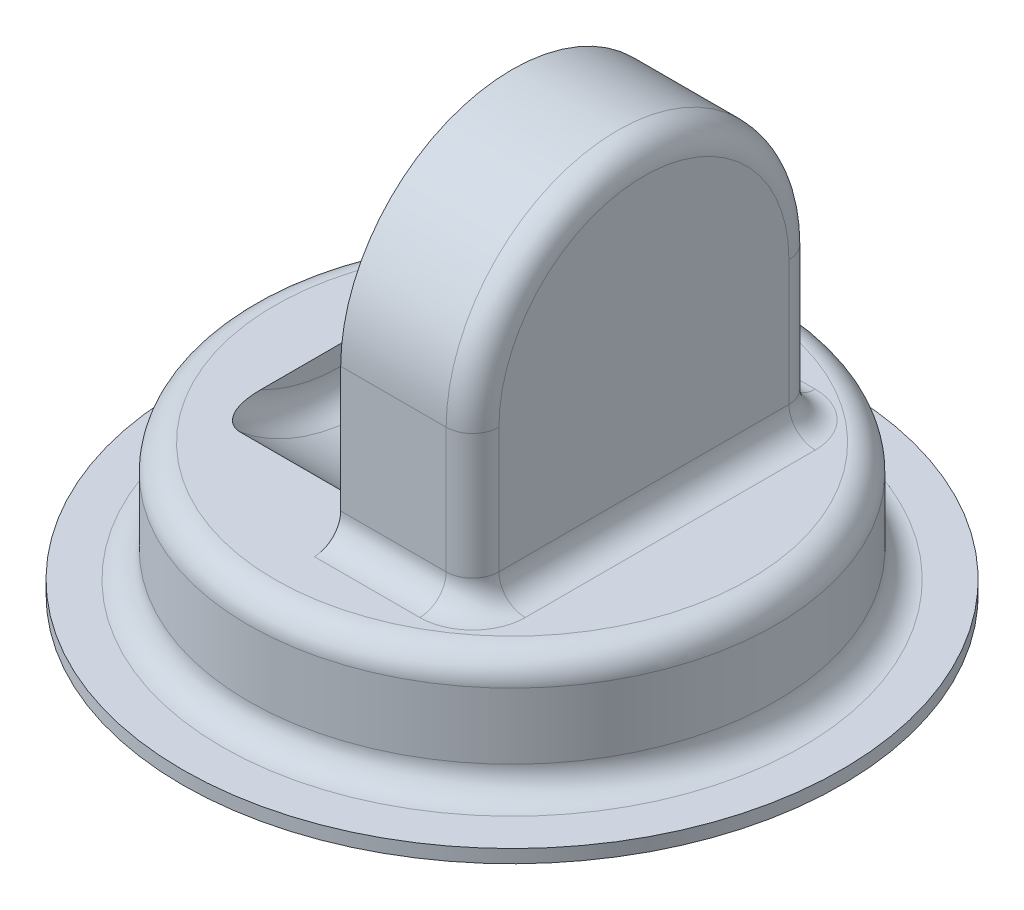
ISO-10303-21;
HEADER;
FILE_DESCRIPTION(('STEP AP214'),'2;1');
FILE_NAME('part.step','',(''),(''),'','','');
FILE_SCHEMA(('AUTOMOTIVE_DESIGN { 1 0 10303 214 1 1 1 1 }'));
ENDSEC;
DATA;
#1=APPLICATION_CONTEXT('core data for automotive mechanical design processes');
#2=APPLICATION_PROTOCOL_DEFINITION('international standard','automotive_design',2000,#1);
#3=PRODUCT_CONTEXT('',#1,'mechanical');
#4=PRODUCT('Part','Part','',(#3));
#5=PRODUCT_RELATED_PRODUCT_CATEGORY('part','',(#4));
#6=PRODUCT_DEFINITION_FORMATION('','',#4);
#7=PRODUCT_DEFINITION_CONTEXT('part definition',#1,'design');
#8=PRODUCT_DEFINITION('design','',#6,#7);
#9=PRODUCT_DEFINITION_SHAPE('','',#8);
#10=(LENGTH_UNIT() NAMED_UNIT(*) SI_UNIT(.MILLI.,.METRE.));
#11=(NAMED_UNIT(*) PLANE_ANGLE_UNIT() SI_UNIT($,.RADIAN.));
#12=(NAMED_UNIT(*) SI_UNIT($,.STERADIAN.) SOLID_ANGLE_UNIT());
#13=UNCERTAINTY_MEASURE_WITH_UNIT(LENGTH_MEASURE(1.E-05),#10,'distance_accuracy_value','');
#14=(GEOMETRIC_REPRESENTATION_CONTEXT(3) GLOBAL_UNCERTAINTY_ASSIGNED_CONTEXT((#13)) GLOBAL_UNIT_ASSIGNED_CONTEXT((#10,
#11,#12)) REPRESENTATION_CONTEXT('',''));
#15=CARTESIAN_POINT('',(0.,0.,0.));
#16=DIRECTION('',(0.,0.,1.));
#17=DIRECTION('',(1.,0.,0.));
#18=AXIS2_PLACEMENT_3D('',#15,#16,#17);
#19=CARTESIAN_POINT('',(0.,10.,0.));
#20=DIRECTION('',(0.,-1.,0.));
#21=DIRECTION('',(0.,0.,-1.));
#22=AXIS2_PLACEMENT_3D('',#19,#20,#21);
#23=CYLINDRICAL_SURFACE('',#22,250.);
#24=CARTESIAN_POINT('',(0.,10.,0.));
#25=DIRECTION('',(0.,1.,0.));
#26=DIRECTION('',(0.,0.,1.));
#27=AXIS2_PLACEMENT_3D('',#24,#25,#26);
#28=CIRCLE('',#27,250.);
#29=CARTESIAN_POINT('',(0.,10.,250.));
#30=VERTEX_POINT('',#29);
#31=EDGE_CURVE('E376',#30,#30,#28,.T.);
#32=ORIENTED_EDGE('',*,*,#31,.F.);
#33=EDGE_LOOP('',(#32));
#34=FACE_BOUND('',#33,.T.);
#35=CARTESIAN_POINT('',(0.,0.,0.));
#36=DIRECTION('',(0.,1.,0.));
#37=DIRECTION('',(0.,0.,1.));
#38=AXIS2_PLACEMENT_3D('',#35,#36,#37);
#39=CIRCLE('',#38,250.);
#40=CARTESIAN_POINT('',(0.,0.,250.));
#41=VERTEX_POINT('',#40);
#42=EDGE_CURVE('E375',#41,#41,#39,.T.);
#43=ORIENTED_EDGE('',*,*,#42,.T.);
#44=EDGE_LOOP('',(#43));
#45=FACE_BOUND('',#44,.T.);
#46=ADVANCED_FACE('F32',(#34,#45),#23,.T.);
#47=CARTESIAN_POINT('',(0.,10.,0.));
#48=DIRECTION('',(0.,1.,0.));
#49=DIRECTION('',(0.,0.,1.));
#50=AXIS2_PLACEMENT_3D('',#47,#48,#49);
#51=PLANE('',#50);
#52=CARTESIAN_POINT('',(0.,10.,0.));
#53=DIRECTION('',(0.,1.,0.));
#54=DIRECTION('',(0.,0.,1.));
#55=AXIS2_PLACEMENT_3D('',#52,#53,#54);
#56=CIRCLE('',#55,220.);
#57=CARTESIAN_POINT('',(0.,10.,220.));
#58=VERTEX_POINT('',#57);
#59=EDGE_CURVE('E433',#58,#58,#56,.F.);
#60=ORIENTED_EDGE('',*,*,#59,.T.);
#61=EDGE_LOOP('',(#60));
#62=FACE_BOUND('',#61,.T.);
#63=ORIENTED_EDGE('',*,*,#31,.T.);
#64=EDGE_LOOP('',(#63));
#65=FACE_BOUND('',#64,.T.);
#66=ADVANCED_FACE('F493',(#62,#65),#51,.T.);
#67=CARTESIAN_POINT('',(0.,0.,0.));
#68=DIRECTION('',(0.,1.,0.));
#69=DIRECTION('',(0.,0.,1.));
#70=AXIS2_PLACEMENT_3D('',#67,#68,#69);
#71=PLANE('',#70);
#72=CARTESIAN_POINT('',(0.,0.,0.));
#73=DIRECTION('',(0.,1.,0.));
#74=DIRECTION('',(0.,0.,1.));
#75=AXIS2_PLACEMENT_3D('',#72,#73,#74);
#76=CIRCLE('',#75,220.);
#77=CARTESIAN_POINT('',(0.,0.,220.));
#78=VERTEX_POINT('',#77);
#79=EDGE_CURVE('E312',#78,#78,#76,.F.);
#80=ORIENTED_EDGE('',*,*,#79,.F.);
#81=EDGE_LOOP('',(#80));
#82=FACE_BOUND('',#81,.T.);
#83=ORIENTED_EDGE('',*,*,#42,.F.);
#84=EDGE_LOOP('',(#83));
#85=FACE_BOUND('',#84,.T.);
#86=ADVANCED_FACE('F500',(#82,#85),#71,.F.);
#87=CARTESIAN_POINT('',(0.,100.,0.));
#88=DIRECTION('',(0.,-1.,0.));
#89=DIRECTION('',(0.,0.,-1.));
#90=AXIS2_PLACEMENT_3D('',#87,#88,#89);
#91=CYLINDRICAL_SURFACE('',#90,200.);
#92=CARTESIAN_POINT('',(0.,30.,0.));
#93=DIRECTION('',(0.,1.,0.));
#94=DIRECTION('',(0.,0.,1.));
#95=AXIS2_PLACEMENT_3D('',#92,#93,#94);
#96=CIRCLE('',#95,200.);
#97=CARTESIAN_POINT('',(0.,30.,-200.));
#98=VERTEX_POINT('',#97);
#99=EDGE_CURVE('E430',#98,#98,#96,.T.);
#100=CARTESIAN_POINT('',(0.,80.,0.));
#101=DIRECTION('',(0.,1.,0.));
#102=DIRECTION('',(0.,0.,1.));
#103=AXIS2_PLACEMENT_3D('',#100,#101,#102);
#104=CIRCLE('',#103,200.);
#105=CARTESIAN_POINT('',(0.,80.,-200.));
#106=VERTEX_POINT('',#105);
#107=EDGE_CURVE('E427',#106,#106,#104,.F.);
#108=CARTESIAN_POINT('',(0.,30.,-200.));
#109=CARTESIAN_POINT('',(0.,30.5208333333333,-200.));
#110=CARTESIAN_POINT('',(0.,31.0416666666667,-200.));
#111=CARTESIAN_POINT('',(0.,32.0833333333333,-200.));
#112=CARTESIAN_POINT('',(0.,32.6041666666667,-200.));
#113=CARTESIAN_POINT('',(0.,33.6458333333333,-200.));
#114=CARTESIAN_POINT('',(0.,34.1666666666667,-200.));
#115=CARTESIAN_POINT('',(0.,35.2083333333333,-200.));
#116=CARTESIAN_POINT('',(0.,35.7291666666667,-200.));
#117=CARTESIAN_POINT('',(0.,36.7708333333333,-200.));
#118=CARTESIAN_POINT('',(0.,37.2916666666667,-200.));
#119=CARTESIAN_POINT('',(0.,38.3333333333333,-200.));
#120=CARTESIAN_POINT('',(0.,38.8541666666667,-200.));
#121=CARTESIAN_POINT('',(0.,39.8958333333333,-200.));
#122=CARTESIAN_POINT('',(0.,40.4166666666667,-200.));
#123=CARTESIAN_POINT('',(0.,41.4583333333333,-200.));
#124=CARTESIAN_POINT('',(0.,41.9791666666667,-200.));
#125=CARTESIAN_POINT('',(0.,43.0208333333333,-200.));
#126=CARTESIAN_POINT('',(0.,43.5416666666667,-200.));
#127=CARTESIAN_POINT('',(0.,44.5833333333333,-200.));
#128=CARTESIAN_POINT('',(0.,45.1041666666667,-200.));
#129=CARTESIAN_POINT('',(0.,46.1458333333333,-200.));
#130=CARTESIAN_POINT('',(0.,46.6666666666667,-200.));
#131=CARTESIAN_POINT('',(0.,47.7083333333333,-200.));
#132=CARTESIAN_POINT('',(0.,48.2291666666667,-200.));
#133=CARTESIAN_POINT('',(0.,49.2708333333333,-200.));
#134=CARTESIAN_POINT('',(0.,49.7916666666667,-200.));
#135=CARTESIAN_POINT('',(0.,50.8333333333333,-200.));
#136=CARTESIAN_POINT('',(0.,51.3541666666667,-200.));
#137=CARTESIAN_POINT('',(0.,52.3958333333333,-200.));
#138=CARTESIAN_POINT('',(0.,52.9166666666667,-200.));
#139=CARTESIAN_POINT('',(0.,53.9583333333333,-200.));
#140=CARTESIAN_POINT('',(0.,54.4791666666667,-200.));
#141=CARTESIAN_POINT('',(0.,55.5208333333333,-200.));
#142=CARTESIAN_POINT('',(0.,56.0416666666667,-200.));
#143=CARTESIAN_POINT('',(0.,57.0833333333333,-200.));
#144=CARTESIAN_POINT('',(0.,57.6041666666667,-200.));
#145=CARTESIAN_POINT('',(0.,58.6458333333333,-200.));
#146=CARTESIAN_POINT('',(0.,59.1666666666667,-200.));
#147=CARTESIAN_POINT('',(0.,60.2083333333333,-200.));
#148=CARTESIAN_POINT('',(0.,60.7291666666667,-200.));
#149=CARTESIAN_POINT('',(0.,61.7708333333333,-200.));
#150=CARTESIAN_POINT('',(0.,62.2916666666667,-200.));
#151=CARTESIAN_POINT('',(0.,63.3333333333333,-200.));
#152=CARTESIAN_POINT('',(0.,63.8541666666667,-200.));
#153=CARTESIAN_POINT('',(0.,64.8958333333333,-200.));
#154=CARTESIAN_POINT('',(0.,65.4166666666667,-200.));
#155=CARTESIAN_POINT('',(0.,66.4583333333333,-200.));
#156=CARTESIAN_POINT('',(0.,66.9791666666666,-200.));
#157=CARTESIAN_POINT('',(0.,68.0208333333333,-200.));
#158=CARTESIAN_POINT('',(0.,68.5416666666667,-200.));
#159=CARTESIAN_POINT('',(0.,69.5833333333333,-200.));
#160=CARTESIAN_POINT('',(0.,70.1041666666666,-200.));
#161=CARTESIAN_POINT('',(0.,71.1458333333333,-200.));
#162=CARTESIAN_POINT('',(0.,71.6666666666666,-200.));
#163=CARTESIAN_POINT('',(0.,72.7083333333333,-200.));
#164=CARTESIAN_POINT('',(0.,73.2291666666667,-200.));
#165=CARTESIAN_POINT('',(0.,74.2708333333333,-200.));
#166=CARTESIAN_POINT('',(0.,74.7916666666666,-200.));
#167=CARTESIAN_POINT('',(0.,75.8333333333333,-200.));
#168=CARTESIAN_POINT('',(0.,76.3541666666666,-200.));
#169=CARTESIAN_POINT('',(0.,77.3958333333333,-200.));
#170=CARTESIAN_POINT('',(0.,77.9166666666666,-200.));
#171=CARTESIAN_POINT('',(0.,78.9583333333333,-200.));
#172=CARTESIAN_POINT('',(0.,79.4791666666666,-200.));
#173=CARTESIAN_POINT('',(0.,80.,-200.));
#174=B_SPLINE_CURVE_WITH_KNOTS('',3,(#108,#109,#110,#111,#112,#113,#114,#115,#116,#117,#118,
#119,#120,#121,#122,#123,#124,#125,#126,#127,#128,#129,#130,#131,#132,#133,#134,#135,#136,#137,
#138,#139,#140,#141,#142,#143,#144,#145,#146,#147,#148,#149,#150,#151,#152,#153,#154,#155,#156,
#157,#158,#159,#160,#161,#162,#163,#164,#165,#166,#167,#168,#169,#170,#171,#172,#173),
.UNSPECIFIED.,.F.,.F.,(4,2,2,2,2,2,2,2,2,2,2,2,2,2,2,2,2,2,2,2,2,2,2,2,2,2,2,2,2,2,2,2,4),(0.,
1.56249999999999,3.125,4.6875,6.25000000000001,7.81249999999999,9.37499999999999,10.9375,12.5,
14.0625,15.625,17.1875,18.75,20.3125,21.875,23.4375,25.,26.5625,28.125,29.6875,31.25,32.8125,
34.375,35.9375,37.5,39.0625,40.625,42.1875,43.75,45.3125,46.875,48.4375,50.),.UNSPECIFIED.);
#175=EDGE_CURVE('BSEAM464',#98,#106,#174,.T.);
#176=ORIENTED_EDGE('',*,*,#99,.T.);
#177=ORIENTED_EDGE('',*,*,#107,.T.);
#178=ORIENTED_EDGE('',*,*,#175,.T.);
#179=ORIENTED_EDGE('',*,*,#175,.F.);
#180=EDGE_LOOP('',(#176,#178,#177,#179));
#181=FACE_BOUND('',#180,.T.);
#182=ADVANCED_FACE('F464',(#181),#91,.T.);
#183=CARTESIAN_POINT('',(0.,100.,0.));
#184=DIRECTION('',(0.,1.,0.));
#185=DIRECTION('',(0.,0.,1.));
#186=AXIS2_PLACEMENT_3D('',#183,#184,#185);
#187=PLANE('',#186);
#188=CARTESIAN_POINT('',(0.,100.,0.));
#189=DIRECTION('',(0.,1.,0.));
#190=DIRECTION('',(0.,0.,1.));
#191=AXIS2_PLACEMENT_3D('',#188,#189,#190);
#192=CIRCLE('',#191,180.);
#193=CARTESIAN_POINT('',(0.,100.,180.));
#194=VERTEX_POINT('',#193);
#195=EDGE_CURVE('E401',#194,#194,#192,.T.);
#196=ORIENTED_EDGE('',*,*,#195,.T.);
#197=EDGE_LOOP('',(#196));
#198=FACE_BOUND('',#197,.T.);
#199=DIRECTION('',(-1.,0.,0.));
#200=VECTOR('',#199,1.);
#201=CARTESIAN_POINT('',(0.,100.,150.));
#202=LINE('',#201,#200);
#203=CARTESIAN_POINT('',(80.,100.,150.));
#204=VERTEX_POINT('',#203);
#205=CARTESIAN_POINT('',(0.,100.,150.));
#206=VERTEX_POINT('',#205);
#207=EDGE_CURVE('E394',#204,#206,#202,.T.);
#208=ORIENTED_EDGE('',*,*,#207,.T.);
#209=DIRECTION('',(0.,0.,-1.));
#210=VECTOR('',#209,1.);
#211=CARTESIAN_POINT('',(0.,100.,130.));
#212=LINE('',#211,#210);
#213=CARTESIAN_POINT('',(0.,100.,60.6217782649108));
#214=VERTEX_POINT('',#213);
#215=EDGE_CURVE('E57',#206,#214,#212,.T.);
#216=ORIENTED_EDGE('',*,*,#215,.T.);
#217=CARTESIAN_POINT('',(0.,100.,60.6217782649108));
#218=CARTESIAN_POINT('',(-3.39484728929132E-05,100.,61.4593800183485));
#219=CARTESIAN_POINT('',(-0.0114453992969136,100.,62.2970611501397));
#220=CARTESIAN_POINT('',(-0.0594907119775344,100.,63.9719607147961));
#221=CARTESIAN_POINT('',(-0.0961327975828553,100.,64.8091789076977));
#222=CARTESIAN_POINT('',(-0.197398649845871,100.,66.4867659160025));
#223=CARTESIAN_POINT('',(-0.262181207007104,100.,67.3271253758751));
#224=CARTESIAN_POINT('',(-0.422534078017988,100.,69.0048520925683));
#225=CARTESIAN_POINT('',(-0.518101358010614,100.,69.8422196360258));
#226=CARTESIAN_POINT('',(-0.744483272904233,100.,71.5229813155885));
#227=CARTESIAN_POINT('',(-0.875727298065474,100.,72.3663182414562));
#228=CARTESIAN_POINT('',(-1.17640530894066,100.,74.0463229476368));
#229=CARTESIAN_POINT('',(-1.34584374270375,100.,74.8829899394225));
#230=CARTESIAN_POINT('',(-1.72630580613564,100.,76.544794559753));
#231=CARTESIAN_POINT('',(-1.93722990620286,100.,77.3699548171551));
#232=CARTESIAN_POINT('',(-2.40510009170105,100.,79.0069774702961));
#233=CARTESIAN_POINT('',(-2.66203065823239,100.,79.8188442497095));
#234=CARTESIAN_POINT('',(-3.14417689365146,100.,81.1902895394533));
#235=CARTESIAN_POINT('',(-3.35675139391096,100.,81.7543226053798));
#236=CARTESIAN_POINT('',(-3.80916007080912,100.,82.871459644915));
#237=CARTESIAN_POINT('',(-4.04899638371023,100.,83.4245627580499));
#238=CARTESIAN_POINT('',(-4.55745993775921,100.,84.5165291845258));
#239=CARTESIAN_POINT('',(-4.82604815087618,100.,85.0554105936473));
#240=CARTESIAN_POINT('',(-5.39421061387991,100.,86.1166205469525));
#241=CARTESIAN_POINT('',(-5.69378408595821,100.,86.6389495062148));
#242=CARTESIAN_POINT('',(-6.32890774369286,100.,87.6682460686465));
#243=CARTESIAN_POINT('',(-6.66477029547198,100.,88.1750225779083));
#244=CARTESIAN_POINT('',(-7.19510749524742,100.,88.9161034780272));
#245=CARTESIAN_POINT('',(-7.37631959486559,100.,89.1599608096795));
#246=CARTESIAN_POINT('',(-7.74789641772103,100.,89.6407529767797));
#247=CARTESIAN_POINT('',(-7.93826477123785,100.,89.8776850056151));
#248=CARTESIAN_POINT('',(-8.52293831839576,100.,90.5764214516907));
#249=CARTESIAN_POINT('',(-8.93120146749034,100.,91.0267148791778));
#250=CARTESIAN_POINT('',(-9.78577247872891,100.,91.8894588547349));
#251=CARTESIAN_POINT('',(-10.2320618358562,100.,92.3019276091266));
#252=CARTESIAN_POINT('',(-11.0258099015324,100.,92.9665110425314));
#253=CARTESIAN_POINT('',(-11.3636936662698,100.,93.2300896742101));
#254=CARTESIAN_POINT('',(-12.0579608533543,100.,93.7313394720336));
#255=CARTESIAN_POINT('',(-12.414333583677,100.,93.9690253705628));
#256=CARTESIAN_POINT('',(-13.1440137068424,100.,94.4148246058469));
#257=CARTESIAN_POINT('',(-13.5172787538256,100.,94.6230070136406));
#258=CARTESIAN_POINT('',(-14.2801174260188,100.,95.0071374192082));
#259=CARTESIAN_POINT('',(-14.6696912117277,100.,95.1830850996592));
#260=CARTESIAN_POINT('',(-15.4558394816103,100.,95.4966205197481));
#261=CARTESIAN_POINT('',(-15.8521580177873,100.,95.6348473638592));
#262=CARTESIAN_POINT('',(-16.6557672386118,100.,95.8743137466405));
#263=CARTESIAN_POINT('',(-17.0630558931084,100.,95.975560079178));
#264=CARTESIAN_POINT('',(-17.8896763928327,100.,96.1397018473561));
#265=CARTESIAN_POINT('',(-18.3090882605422,100.,96.2022003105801));
#266=CARTESIAN_POINT('',(-18.9413462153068,100.,96.2648721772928));
#267=CARTESIAN_POINT('',(-19.1527515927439,100.,96.2805835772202));
#268=CARTESIAN_POINT('',(-19.5760927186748,100.,96.3015510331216));
#269=CARTESIAN_POINT('',(-19.7880284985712,100.,96.306806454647));
#270=CARTESIAN_POINT('',(-20.,100.,96.3068014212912));
#271=B_SPLINE_CURVE_WITH_KNOTS('',3,(#217,#218,#219,#220,#221,#222,#223,#224,#225,#226,#227,
#228,#229,#230,#231,#232,#233,#234,#235,#236,#237,#238,#239,#240,#241,#242,#243,#244,#245,#246,
#247,#248,#249,#250,#251,#252,#253,#254,#255,#256,#257,#258,#259,#260,#261,#262,#263,#264,#265,
#266,#267,#268,#269,#270),.UNSPECIFIED.,.F.,.F.,(4,2,2,2,2,2,2,2,2,2,2,2,2,2,2,2,2,2,2,2,2,2,2,
2,2,2,4),(0.,2.51284641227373,5.02651225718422,7.55455026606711,10.0823392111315,
12.6420126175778,15.2019842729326,17.7558875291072,20.3089309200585,22.1165937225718,
23.924398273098,25.7297792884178,27.535114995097,29.3574598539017,30.268717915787,
31.1803403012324,33.0015720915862,34.8219226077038,36.1064709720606,37.3902845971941,
38.6710411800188,39.9518103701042,41.2093002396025,42.4665589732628,43.7364942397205,
44.3722346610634,45.0080136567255),.UNSPECIFIED.);
#272=CARTESIAN_POINT('',(-20.,100.,96.3068014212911));
#273=VERTEX_POINT('',#272);
#274=EDGE_CURVE('E449',#214,#273,#271,.T.);
#275=ORIENTED_EDGE('',*,*,#274,.T.);
#276=DIRECTION('',(1.,0.,0.));
#277=VECTOR('',#276,1.);
#278=CARTESIAN_POINT('',(-130.,100.,96.3068014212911));
#279=LINE('',#278,#277);
#280=CARTESIAN_POINT('',(-110.,100.,96.3068014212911));
#281=VERTEX_POINT('',#280);
#282=EDGE_CURVE('E358',#281,#273,#279,.T.);
#283=ORIENTED_EDGE('',*,*,#282,.F.);
#284=CARTESIAN_POINT('',(-110.,100.,96.3068014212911));
#285=CARTESIAN_POINT('',(-110.209404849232,100.,96.3068062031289));
#286=CARTESIAN_POINT('',(-110.418775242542,100.,96.3016774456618));
#287=CARTESIAN_POINT('',(-110.837004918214,100.,96.2812140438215));
#288=CARTESIAN_POINT('',(-111.045864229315,100.,96.2658799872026));
#289=CARTESIAN_POINT('',(-111.67056749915,100.,96.2047078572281));
#290=CARTESIAN_POINT('',(-112.085022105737,100.,96.1436995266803));
#291=CARTESIAN_POINT('',(-112.90228593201,100.,95.9833873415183));
#292=CARTESIAN_POINT('',(-113.305168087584,100.,95.8844497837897));
#293=CARTESIAN_POINT('',(-114.100313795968,100.,95.6503596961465));
#294=CARTESIAN_POINT('',(-114.492575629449,100.,95.5152013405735));
#295=CARTESIAN_POINT('',(-115.262490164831,100.,95.2118520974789));
#296=CARTESIAN_POINT('',(-115.640188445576,100.,95.0437763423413));
#297=CARTESIAN_POINT('',(-116.380458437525,100.,94.6772288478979));
#298=CARTESIAN_POINT('',(-116.74303067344,100.,94.4787581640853));
#299=CARTESIAN_POINT('',(-117.452466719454,100.,94.0539865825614));
#300=CARTESIAN_POINT('',(-117.799296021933,100.,93.8276282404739));
#301=CARTESIAN_POINT('',(-118.47576859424,100.,93.3502851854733));
#302=CARTESIAN_POINT('',(-118.805402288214,100.,93.0992869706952));
#303=CARTESIAN_POINT('',(-119.589241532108,100.,92.4593665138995));
#304=CARTESIAN_POINT('',(-120.033846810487,100.,92.0586501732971));
#305=CARTESIAN_POINT('',(-120.88610750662,100.,91.219526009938));
#306=CARTESIAN_POINT('',(-121.293744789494,100.,90.7810998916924));
#307=CARTESIAN_POINT('',(-121.878197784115,100.,90.1001021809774));
#308=CARTESIAN_POINT('',(-122.068631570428,100.,89.8690498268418));
#309=CARTESIAN_POINT('',(-122.440543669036,100.,89.399995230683));
#310=CARTESIAN_POINT('',(-122.622025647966,100.,89.1619958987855));
#311=CARTESIAN_POINT('',(-123.153482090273,100.,88.4384073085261));
#312=CARTESIAN_POINT('',(-123.490459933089,100.,87.9432358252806));
#313=CARTESIAN_POINT('',(-124.309254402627,100.,86.6516668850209));
#314=CARTESIAN_POINT('',(-124.767771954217,100.,85.8404917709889));
#315=CARTESIAN_POINT('',(-125.612546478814,100.,84.1812562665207));
#316=CARTESIAN_POINT('',(-125.998760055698,100.,83.3331740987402));
#317=CARTESIAN_POINT('',(-126.70760888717,100.,81.6059238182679));
#318=CARTESIAN_POINT('',(-127.029903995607,100.,80.7266172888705));
#319=CARTESIAN_POINT('',(-127.614985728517,100.,78.9488098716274));
#320=CARTESIAN_POINT('',(-127.877785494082,100.,78.0503132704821));
#321=CARTESIAN_POINT('',(-128.290938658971,100.,76.4658686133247));
#322=CARTESIAN_POINT('',(-128.452980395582,100.,75.7829178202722));
#323=CARTESIAN_POINT('',(-128.74931729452,100.,74.4109677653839));
#324=CARTESIAN_POINT('',(-128.883609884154,100.,73.7219679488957));
#325=CARTESIAN_POINT('',(-129.126642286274,100.,72.33889793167));
#326=CARTESIAN_POINT('',(-129.235359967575,100.,71.64482387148));
#327=CARTESIAN_POINT('',(-129.429045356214,100.,70.2533640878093));
#328=CARTESIAN_POINT('',(-129.514012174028,100.,69.5559782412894));
#329=CARTESIAN_POINT('',(-129.660496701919,100.,68.1729528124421));
#330=CARTESIAN_POINT('',(-129.722451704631,100.,67.4873591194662));
#331=CARTESIAN_POINT('',(-129.826839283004,100.,66.1146706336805));
#332=CARTESIAN_POINT('',(-129.869271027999,100.,65.4275757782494));
#333=CARTESIAN_POINT('',(-129.935986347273,100.,64.0541658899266));
#334=CARTESIAN_POINT('',(-129.960312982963,100.,63.3678529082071));
#335=CARTESIAN_POINT('',(-129.992311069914,100.,61.9949410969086));
#336=CARTESIAN_POINT('',(-129.99998513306,100.,61.308342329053));
#337=CARTESIAN_POINT('',(-130.,100.,60.6217782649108));
#338=B_SPLINE_CURVE_WITH_KNOTS('',3,(#284,#285,#286,#287,#288,#289,#290,#291,#292,#293,#294,
#295,#296,#297,#298,#299,#300,#301,#302,#303,#304,#305,#306,#307,#308,#309,#310,#311,#312,#313,
#314,#315,#316,#317,#318,#319,#320,#321,#322,#323,#324,#325,#326,#327,#328,#329,#330,#331,#332,
#333,#334,#335,#336,#337),.UNSPECIFIED.,.F.,.F.,(4,2,2,2,2,2,2,2,2,2,2,2,2,2,2,2,2,2,2,2,2,2,2,
2,2,2,4),(0.,0.628083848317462,1.25613152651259,2.51077719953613,3.75359967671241,
4.99662216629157,6.2353722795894,7.47407938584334,8.71538209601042,9.95736883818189,
11.7502617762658,13.5440295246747,14.4420981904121,15.3397959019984,17.1352242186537,
19.9262294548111,22.7189044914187,25.5260640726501,28.3326030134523,30.4377638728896,
32.5431198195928,34.6502909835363,36.7575410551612,38.8224045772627,40.8873559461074,
42.9473801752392,45.0070812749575),.UNSPECIFIED.);
#339=CARTESIAN_POINT('',(-130.,100.,60.6217782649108));
#340=VERTEX_POINT('',#339);
#341=EDGE_CURVE('E11',#281,#340,#338,.T.);
#342=ORIENTED_EDGE('',*,*,#341,.T.);
#343=DIRECTION('',(0.,0.,-1.));
#344=VECTOR('',#343,1.);
#345=CARTESIAN_POINT('',(-130.,100.,0.));
#346=LINE('',#345,#344);
#347=CARTESIAN_POINT('',(-130.,100.,-60.6217782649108));
#348=VERTEX_POINT('',#347);
#349=EDGE_CURVE('E379',#340,#348,#346,.T.);
#350=ORIENTED_EDGE('',*,*,#349,.T.);
#351=CARTESIAN_POINT('',(-130.,100.,-60.6217782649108));
#352=CARTESIAN_POINT('',(-129.999966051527,100.,-61.4593800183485));
#353=CARTESIAN_POINT('',(-129.988554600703,100.,-62.2970611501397));
#354=CARTESIAN_POINT('',(-129.940509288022,100.,-63.9719607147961));
#355=CARTESIAN_POINT('',(-129.903867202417,100.,-64.8091789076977));
#356=CARTESIAN_POINT('',(-129.802601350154,100.,-66.4867659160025));
#357=CARTESIAN_POINT('',(-129.737818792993,100.,-67.3271253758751));
#358=CARTESIAN_POINT('',(-129.577465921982,100.,-69.0048520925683));
#359=CARTESIAN_POINT('',(-129.481898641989,100.,-69.8422196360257));
#360=CARTESIAN_POINT('',(-129.255516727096,100.,-71.5229813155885));
#361=CARTESIAN_POINT('',(-129.124272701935,100.,-72.3663182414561));
#362=CARTESIAN_POINT('',(-128.823594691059,100.,-74.0463229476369));
#363=CARTESIAN_POINT('',(-128.654156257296,100.,-74.8829899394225));
#364=CARTESIAN_POINT('',(-128.273694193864,100.,-76.544794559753));
#365=CARTESIAN_POINT('',(-128.062770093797,100.,-77.3699548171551));
#366=CARTESIAN_POINT('',(-127.594899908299,100.,-79.0069774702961));
#367=CARTESIAN_POINT('',(-127.337969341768,100.,-79.8188442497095));
#368=CARTESIAN_POINT('',(-126.855823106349,100.,-81.1902895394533));
#369=CARTESIAN_POINT('',(-126.643248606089,100.,-81.7543226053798));
#370=CARTESIAN_POINT('',(-126.190839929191,100.,-82.871459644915));
#371=CARTESIAN_POINT('',(-125.95100361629,100.,-83.42456275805));
#372=CARTESIAN_POINT('',(-125.442540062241,100.,-84.5165291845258));
#373=CARTESIAN_POINT('',(-125.173951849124,100.,-85.0554105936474));
#374=CARTESIAN_POINT('',(-124.60578938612,100.,-86.1166205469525));
#375=CARTESIAN_POINT('',(-124.306215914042,100.,-86.6389495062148));
#376=CARTESIAN_POINT('',(-123.671092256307,100.,-87.6682460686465));
#377=CARTESIAN_POINT('',(-123.335229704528,100.,-88.1750225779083));
#378=CARTESIAN_POINT('',(-122.804892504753,100.,-88.9161034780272));
#379=CARTESIAN_POINT('',(-122.623680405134,100.,-89.1599608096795));
#380=CARTESIAN_POINT('',(-122.252103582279,100.,-89.6407529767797));
#381=CARTESIAN_POINT('',(-122.061735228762,100.,-89.8776850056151));
#382=CARTESIAN_POINT('',(-121.477061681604,100.,-90.5764214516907));
#383=CARTESIAN_POINT('',(-121.06879853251,100.,-91.0267148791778));
#384=CARTESIAN_POINT('',(-120.214227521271,100.,-91.8894588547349));
#385=CARTESIAN_POINT('',(-119.767938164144,100.,-92.3019276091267));
#386=CARTESIAN_POINT('',(-118.974190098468,100.,-92.9665110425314));
#387=CARTESIAN_POINT('',(-118.63630633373,100.,-93.2300896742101));
#388=CARTESIAN_POINT('',(-117.942039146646,100.,-93.7313394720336));
#389=CARTESIAN_POINT('',(-117.585666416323,100.,-93.9690253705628));
#390=CARTESIAN_POINT('',(-116.855986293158,100.,-94.4148246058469));
#391=CARTESIAN_POINT('',(-116.482721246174,100.,-94.6230070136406));
#392=CARTESIAN_POINT('',(-115.719882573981,100.,-95.0071374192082));
#393=CARTESIAN_POINT('',(-115.330308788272,100.,-95.1830850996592));
#394=CARTESIAN_POINT('',(-114.54416051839,100.,-95.4966205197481));
#395=CARTESIAN_POINT('',(-114.147841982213,100.,-95.6348473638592));
#396=CARTESIAN_POINT('',(-113.344232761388,100.,-95.8743137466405));
#397=CARTESIAN_POINT('',(-112.936944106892,100.,-95.975560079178));
#398=CARTESIAN_POINT('',(-112.110323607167,100.,-96.1397018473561));
#399=CARTESIAN_POINT('',(-111.690911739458,100.,-96.2022003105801));
#400=CARTESIAN_POINT('',(-111.058653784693,100.,-96.2648721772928));
#401=CARTESIAN_POINT('',(-110.847248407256,100.,-96.2805835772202));
#402=CARTESIAN_POINT('',(-110.423907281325,100.,-96.3015510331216));
#403=CARTESIAN_POINT('',(-110.211971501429,100.,-96.306806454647));
#404=CARTESIAN_POINT('',(-110.,100.,-96.3068014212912));
#405=B_SPLINE_CURVE_WITH_KNOTS('',3,(#351,#352,#353,#354,#355,#356,#357,#358,#359,#360,#361,
#362,#363,#364,#365,#366,#367,#368,#369,#370,#371,#372,#373,#374,#375,#376,#377,#378,#379,#380,
#381,#382,#383,#384,#385,#386,#387,#388,#389,#390,#391,#392,#393,#394,#395,#396,#397,#398,#399,
#400,#401,#402,#403,#404),.UNSPECIFIED.,.F.,.F.,(4,2,2,2,2,2,2,2,2,2,2,2,2,2,2,2,2,2,2,2,2,2,2,
2,2,2,4),(0.,2.51284641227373,5.02651225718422,7.5545502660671,10.0823392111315,
12.6420126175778,15.2019842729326,17.7558875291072,20.3089309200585,22.1165937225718,
23.924398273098,25.7297792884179,27.535114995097,29.3574598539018,30.268717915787,
31.1803403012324,33.0015720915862,34.8219226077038,36.1064709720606,37.3902845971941,
38.6710411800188,39.9518103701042,41.2093002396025,42.4665589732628,43.7364942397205,
44.3722346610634,45.0080136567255),.UNSPECIFIED.);
#406=CARTESIAN_POINT('',(-110.,100.,-96.3068014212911));
#407=VERTEX_POINT('',#406);
#408=EDGE_CURVE('E41',#348,#407,#405,.T.);
#409=ORIENTED_EDGE('',*,*,#408,.T.);
#410=DIRECTION('',(1.,0.,0.));
#411=VECTOR('',#410,1.);
#412=CARTESIAN_POINT('',(-130.,100.,-96.3068014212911));
#413=LINE('',#412,#411);
#414=CARTESIAN_POINT('',(-20.,100.,-96.3068014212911));
#415=VERTEX_POINT('',#414);
#416=EDGE_CURVE('E355',#415,#407,#413,.F.);
#417=ORIENTED_EDGE('',*,*,#416,.F.);
#418=CARTESIAN_POINT('',(-20.,100.,-96.3068014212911));
#419=CARTESIAN_POINT('',(-19.7905951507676,100.,-96.3068062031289));
#420=CARTESIAN_POINT('',(-19.5812247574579,100.,-96.3016774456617));
#421=CARTESIAN_POINT('',(-19.1629950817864,100.,-96.2812140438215));
#422=CARTESIAN_POINT('',(-18.9541357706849,100.,-96.2658799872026));
#423=CARTESIAN_POINT('',(-18.3294325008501,100.,-96.2047078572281));
#424=CARTESIAN_POINT('',(-17.9149778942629,100.,-96.1436995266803));
#425=CARTESIAN_POINT('',(-17.0977140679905,100.,-95.9833873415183));
#426=CARTESIAN_POINT('',(-16.6948319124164,100.,-95.8844497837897));
#427=CARTESIAN_POINT('',(-15.8996862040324,100.,-95.6503596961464));
#428=CARTESIAN_POINT('',(-15.5074243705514,100.,-95.5152013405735));
#429=CARTESIAN_POINT('',(-14.7375098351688,100.,-95.2118520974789));
#430=CARTESIAN_POINT('',(-14.359811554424,100.,-95.0437763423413));
#431=CARTESIAN_POINT('',(-13.6195415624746,100.,-94.6772288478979));
#432=CARTESIAN_POINT('',(-13.2569693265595,100.,-94.4787581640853));
#433=CARTESIAN_POINT('',(-12.5475332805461,100.,-94.0539865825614));
#434=CARTESIAN_POINT('',(-12.2007039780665,100.,-93.8276282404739));
#435=CARTESIAN_POINT('',(-11.5242314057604,100.,-93.3502851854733));
#436=CARTESIAN_POINT('',(-11.1945977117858,100.,-93.0992869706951));
#437=CARTESIAN_POINT('',(-10.410758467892,100.,-92.4593665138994));
#438=CARTESIAN_POINT('',(-9.96615318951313,100.,-92.0586501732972));
#439=CARTESIAN_POINT('',(-9.1138924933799,100.,-91.219526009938));
#440=CARTESIAN_POINT('',(-8.70625521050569,100.,-90.7810998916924));
#441=CARTESIAN_POINT('',(-8.12180221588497,100.,-90.1001021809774));
#442=CARTESIAN_POINT('',(-7.93136842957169,100.,-89.8690498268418));
#443=CARTESIAN_POINT('',(-7.55945633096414,100.,-89.399995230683));
#444=CARTESIAN_POINT('',(-7.37797435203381,100.,-89.1619958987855));
#445=CARTESIAN_POINT('',(-6.84651790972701,100.,-88.4384073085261));
#446=CARTESIAN_POINT('',(-6.50954006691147,100.,-87.9432358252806));
#447=CARTESIAN_POINT('',(-5.69074559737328,100.,-86.6516668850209));
#448=CARTESIAN_POINT('',(-5.23222804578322,100.,-85.840491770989));
#449=CARTESIAN_POINT('',(-4.38745352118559,100.,-84.1812562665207));
#450=CARTESIAN_POINT('',(-4.00123994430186,100.,-83.3331740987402));
#451=CARTESIAN_POINT('',(-3.29239111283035,100.,-81.605923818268));
#452=CARTESIAN_POINT('',(-2.97009600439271,100.,-80.7266172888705));
#453=CARTESIAN_POINT('',(-2.38501427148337,100.,-78.9488098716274));
#454=CARTESIAN_POINT('',(-2.12221450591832,100.,-78.0503132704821));
#455=CARTESIAN_POINT('',(-1.70906134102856,100.,-76.4658686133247));
#456=CARTESIAN_POINT('',(-1.54701960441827,100.,-75.7829178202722));
#457=CARTESIAN_POINT('',(-1.25068270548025,100.,-74.4109677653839));
#458=CARTESIAN_POINT('',(-1.11639011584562,100.,-73.7219679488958));
#459=CARTESIAN_POINT('',(-0.873357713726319,100.,-72.33889793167));
#460=CARTESIAN_POINT('',(-0.764640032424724,100.,-71.64482387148));
#461=CARTESIAN_POINT('',(-0.570954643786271,100.,-70.2533640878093));
#462=CARTESIAN_POINT('',(-0.485987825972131,100.,-69.5559782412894));
#463=CARTESIAN_POINT('',(-0.339503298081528,100.,-68.1729528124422));
#464=CARTESIAN_POINT('',(-0.277548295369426,100.,-67.4873591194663));
#465=CARTESIAN_POINT('',(-0.173160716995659,100.,-66.1146706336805));
#466=CARTESIAN_POINT('',(-0.130728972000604,100.,-65.4275757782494));
#467=CARTESIAN_POINT('',(-0.0640136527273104,100.,-64.0541658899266));
#468=CARTESIAN_POINT('',(-0.0396870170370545,100.,-63.3678529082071));
#469=CARTESIAN_POINT('',(-0.00768893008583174,100.,-61.9949410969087));
#470=CARTESIAN_POINT('',(-1.48669395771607E-05,100.,-61.308342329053));
#471=CARTESIAN_POINT('',(0.,100.,-60.6217782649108));
#472=B_SPLINE_CURVE_WITH_KNOTS('',3,(#418,#419,#420,#421,#422,#423,#424,#425,#426,#427,#428,
#429,#430,#431,#432,#433,#434,#435,#436,#437,#438,#439,#440,#441,#442,#443,#444,#445,#446,#447,
#448,#449,#450,#451,#452,#453,#454,#455,#456,#457,#458,#459,#460,#461,#462,#463,#464,#465,#466,
#467,#468,#469,#470,#471),.UNSPECIFIED.,.F.,.F.,(4,2,2,2,2,2,2,2,2,2,2,2,2,2,2,2,2,2,2,2,2,2,2,
2,2,2,4),(0.,0.628083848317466,1.2561315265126,2.51077719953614,3.75359967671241,
4.99662216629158,6.2353722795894,7.47407938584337,8.71538209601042,9.95736883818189,
11.7502617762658,13.5440295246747,14.4420981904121,15.3397959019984,17.1352242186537,
19.9262294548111,22.7189044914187,25.5260640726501,28.3326030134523,30.4377638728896,
32.5431198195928,34.6502909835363,36.7575410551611,38.8224045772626,40.8873559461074,
42.9473801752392,45.0070812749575),.UNSPECIFIED.);
#473=CARTESIAN_POINT('',(0.,100.,-60.6217782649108));
#474=VERTEX_POINT('',#473);
#475=EDGE_CURVE('E442',#415,#474,#472,.T.);
#476=ORIENTED_EDGE('',*,*,#475,.T.);
#477=CARTESIAN_POINT('',(0.,100.,-150.));
#478=VERTEX_POINT('',#477);
#479=EDGE_CURVE('E49',#474,#478,#212,.T.);
#480=ORIENTED_EDGE('',*,*,#479,.T.);
#481=DIRECTION('',(-1.,0.,0.));
#482=VECTOR('',#481,1.);
#483=CARTESIAN_POINT('',(0.,100.,-150.));
#484=LINE('',#483,#482);
#485=CARTESIAN_POINT('',(80.,100.,-150.));
#486=VERTEX_POINT('',#485);
#487=EDGE_CURVE('E399',#478,#486,#484,.F.);
#488=ORIENTED_EDGE('',*,*,#487,.T.);
#489=CARTESIAN_POINT('',(80.,100.,-110.));
#490=DIRECTION('',(0.,1.,0.));
#491=DIRECTION('',(0.,0.,1.));
#492=AXIS2_PLACEMENT_3D('',#489,#490,#491);
#493=CIRCLE('',#492,40.);
#494=CARTESIAN_POINT('',(120.,100.,-110.));
#495=VERTEX_POINT('',#494);
#496=EDGE_CURVE('E396',#495,#486,#493,.T.);
#497=ORIENTED_EDGE('',*,*,#496,.F.);
#498=DIRECTION('',(0.,0.,-1.));
#499=VECTOR('',#498,1.);
#500=CARTESIAN_POINT('',(120.,100.,130.));
#501=LINE('',#500,#499);
#502=CARTESIAN_POINT('',(120.,100.,110.));
#503=VERTEX_POINT('',#502);
#504=EDGE_CURVE('E392',#495,#503,#501,.F.);
#505=ORIENTED_EDGE('',*,*,#504,.T.);
#506=CARTESIAN_POINT('',(80.,100.,110.));
#507=DIRECTION('',(0.,1.,0.));
#508=DIRECTION('',(0.,0.,1.));
#509=AXIS2_PLACEMENT_3D('',#506,#507,#508);
#510=CIRCLE('',#509,40.);
#511=EDGE_CURVE('E389',#204,#503,#510,.T.);
#512=ORIENTED_EDGE('',*,*,#511,.F.);
#513=EDGE_LOOP('',(#208,#216,#275,#283,#342,#350,#409,#417,#476,#480,#488,#497,#505,#512));
#514=FACE_BOUND('',#513,.T.);
#515=ADVANCED_FACE('F458',(#198,#514),#187,.T.);
#516=CARTESIAN_POINT('',(100.,100.,130.));
#517=DIRECTION('',(0.,0.,-1.));
#518=DIRECTION('',(-1.,0.,0.));
#519=AXIS2_PLACEMENT_3D('',#516,#517,#518);
#520=PLANE('',#519);
#521=DIRECTION('',(0.,-1.,0.));
#522=VECTOR('',#521,1.);
#523=CARTESIAN_POINT('',(0.,100.,130.));
#524=LINE('',#523,#522);
#525=CARTESIAN_POINT('',(0.,215.,130.));
#526=VERTEX_POINT('',#525);
#527=CARTESIAN_POINT('',(0.,120.,130.));
#528=VERTEX_POINT('',#527);
#529=EDGE_CURVE('E361',#526,#528,#524,.T.);
#530=ORIENTED_EDGE('',*,*,#529,.T.);
#531=DIRECTION('',(-1.,0.,0.));
#532=VECTOR('',#531,1.);
#533=CARTESIAN_POINT('',(100.,120.,130.));
#534=LINE('',#533,#532);
#535=CARTESIAN_POINT('',(80.,120.,130.));
#536=VERTEX_POINT('',#535);
#537=EDGE_CURVE('E406',#528,#536,#534,.F.);
#538=ORIENTED_EDGE('',*,*,#537,.T.);
#539=DIRECTION('',(0.,-1.,0.));
#540=VECTOR('',#539,1.);
#541=CARTESIAN_POINT('',(80.,215.,130.));
#542=LINE('',#541,#540);
#543=CARTESIAN_POINT('',(80.,215.,130.));
#544=VERTEX_POINT('',#543);
#545=EDGE_CURVE('E404',#536,#544,#542,.F.);
#546=ORIENTED_EDGE('',*,*,#545,.T.);
#547=DIRECTION('',(-1.,0.,0.));
#548=VECTOR('',#547,1.);
#549=CARTESIAN_POINT('',(100.,215.,130.));
#550=LINE('',#549,#548);
#551=EDGE_CURVE('E371',#544,#526,#550,.T.);
#552=ORIENTED_EDGE('',*,*,#551,.T.);
#553=EDGE_LOOP('',(#530,#538,#546,#552));
#554=FACE_BOUND('',#553,.T.);
#555=ADVANCED_FACE('F463',(#554),#520,.F.);
#556=CARTESIAN_POINT('',(100.,100.,-130.));
#557=DIRECTION('',(0.,0.,1.));
#558=DIRECTION('',(1.,0.,0.));
#559=AXIS2_PLACEMENT_3D('',#556,#557,#558);
#560=PLANE('',#559);
#561=DIRECTION('',(0.,1.,0.));
#562=VECTOR('',#561,1.);
#563=CARTESIAN_POINT('',(80.,100.,-130.));
#564=LINE('',#563,#562);
#565=CARTESIAN_POINT('',(80.,215.,-130.));
#566=VERTEX_POINT('',#565);
#567=CARTESIAN_POINT('',(80.,120.,-130.));
#568=VERTEX_POINT('',#567);
#569=EDGE_CURVE('E384',#566,#568,#564,.F.);
#570=ORIENTED_EDGE('',*,*,#569,.T.);
#571=DIRECTION('',(-1.,0.,0.));
#572=VECTOR('',#571,1.);
#573=CARTESIAN_POINT('',(100.,120.,-130.));
#574=LINE('',#573,#572);
#575=CARTESIAN_POINT('',(0.,120.,-130.));
#576=VERTEX_POINT('',#575);
#577=EDGE_CURVE('E386',#568,#576,#574,.T.);
#578=ORIENTED_EDGE('',*,*,#577,.T.);
#579=DIRECTION('',(0.,1.,0.));
#580=VECTOR('',#579,1.);
#581=CARTESIAN_POINT('',(0.,100.,-130.));
#582=LINE('',#581,#580);
#583=CARTESIAN_POINT('',(0.,215.,-130.));
#584=VERTEX_POINT('',#583);
#585=EDGE_CURVE('E365',#576,#584,#582,.T.);
#586=ORIENTED_EDGE('',*,*,#585,.T.);
#587=DIRECTION('',(-1.,0.,0.));
#588=VECTOR('',#587,1.);
#589=CARTESIAN_POINT('',(100.,215.,-130.));
#590=LINE('',#589,#588);
#591=EDGE_CURVE('E373',#566,#584,#590,.T.);
#592=ORIENTED_EDGE('',*,*,#591,.F.);
#593=EDGE_LOOP('',(#570,#578,#586,#592));
#594=FACE_BOUND('',#593,.T.);
#595=ADVANCED_FACE('F562',(#594),#560,.F.);
#596=CARTESIAN_POINT('',(100.,215.,0.));
#597=DIRECTION('',(-1.,0.,0.));
#598=DIRECTION('',(0.,0.,1.));
#599=AXIS2_PLACEMENT_3D('',#596,#597,#598);
#600=CYLINDRICAL_SURFACE('',#599,130.);
#601=ORIENTED_EDGE('',*,*,#551,.F.);
#602=CARTESIAN_POINT('',(80.,215.,0.));
#603=DIRECTION('',(1.,0.,0.));
#604=DIRECTION('',(0.,0.,-1.));
#605=AXIS2_PLACEMENT_3D('',#602,#603,#604);
#606=CIRCLE('',#605,130.);
#607=EDGE_CURVE('E436',#544,#566,#606,.F.);
#608=ORIENTED_EDGE('',*,*,#607,.T.);
#609=ORIENTED_EDGE('',*,*,#591,.T.);
#610=CARTESIAN_POINT('',(0.,215.,0.));
#611=DIRECTION('',(1.,0.,0.));
#612=DIRECTION('',(0.,0.,-1.));
#613=AXIS2_PLACEMENT_3D('',#610,#611,#612);
#614=CIRCLE('',#613,130.);
#615=EDGE_CURVE('E368',#584,#526,#614,.T.);
#616=ORIENTED_EDGE('',*,*,#615,.T.);
#617=EDGE_LOOP('',(#601,#608,#609,#616));
#618=FACE_BOUND('',#617,.T.);
#619=ADVANCED_FACE('F557',(#618),#600,.T.);
#620=CARTESIAN_POINT('',(100.,215.,0.));
#621=DIRECTION('',(1.,0.,0.));
#622=DIRECTION('',(0.,0.,-1.));
#623=AXIS2_PLACEMENT_3D('',#620,#621,#622);
#624=PLANE('',#623);
#625=DIRECTION('',(0.,-1.,0.));
#626=VECTOR('',#625,1.);
#627=CARTESIAN_POINT('',(100.,100.,110.));
#628=LINE('',#627,#626);
#629=CARTESIAN_POINT('',(100.,215.,110.));
#630=VERTEX_POINT('',#629);
#631=CARTESIAN_POINT('',(100.,120.,110.));
#632=VERTEX_POINT('',#631);
#633=EDGE_CURVE('E410',#630,#632,#628,.T.);
#634=ORIENTED_EDGE('',*,*,#633,.T.);
#635=DIRECTION('',(0.,0.,-1.));
#636=VECTOR('',#635,1.);
#637=CARTESIAN_POINT('',(100.,120.,-130.));
#638=LINE('',#637,#636);
#639=CARTESIAN_POINT('',(100.,120.,-110.));
#640=VERTEX_POINT('',#639);
#641=EDGE_CURVE('E415',#632,#640,#638,.T.);
#642=ORIENTED_EDGE('',*,*,#641,.T.);
#643=DIRECTION('',(0.,1.,0.));
#644=VECTOR('',#643,1.);
#645=CARTESIAN_POINT('',(100.,215.,-110.));
#646=LINE('',#645,#644);
#647=CARTESIAN_POINT('',(100.,215.,-110.));
#648=VERTEX_POINT('',#647);
#649=EDGE_CURVE('E412',#640,#648,#646,.T.);
#650=ORIENTED_EDGE('',*,*,#649,.T.);
#651=CARTESIAN_POINT('',(100.,215.,0.));
#652=DIRECTION('',(1.,0.,0.));
#653=DIRECTION('',(0.,0.,-1.));
#654=AXIS2_PLACEMENT_3D('',#651,#652,#653);
#655=CIRCLE('',#654,110.);
#656=EDGE_CURVE('E408',#648,#630,#655,.T.);
#657=ORIENTED_EDGE('',*,*,#656,.T.);
#658=EDGE_LOOP('',(#634,#642,#650,#657));
#659=FACE_BOUND('',#658,.T.);
#660=ADVANCED_FACE('F593',(#659),#624,.T.);
#661=CARTESIAN_POINT('',(0.,215.,0.));
#662=DIRECTION('',(1.,0.,0.));
#663=DIRECTION('',(0.,0.,-1.));
#664=AXIS2_PLACEMENT_3D('',#661,#662,#663);
#665=PLANE('',#664);
#666=CARTESIAN_POINT('',(0.,215.,0.));
#667=DIRECTION('',(-1.,0.,0.));
#668=DIRECTION('',(0.,0.,1.));
#669=AXIS2_PLACEMENT_3D('',#666,#667,#668);
#670=CIRCLE('',#669,50.);
#671=CARTESIAN_POINT('',(0.,215.,50.));
#672=VERTEX_POINT('',#671);
#673=EDGE_CURVE('E954',#672,#672,#670,.T.);
#674=ORIENTED_EDGE('',*,*,#673,.F.);
#675=EDGE_LOOP('',(#674));
#676=FACE_BOUND('',#675,.T.);
#677=ORIENTED_EDGE('',*,*,#479,.F.);
#678=CARTESIAN_POINT('',(0.,215.,0.));
#679=DIRECTION('',(1.,0.,0.));
#680=DIRECTION('',(0.,0.,-1.));
#681=AXIS2_PLACEMENT_3D('',#678,#679,#680);
#682=CIRCLE('',#681,130.);
#683=EDGE_CURVE('E422',#474,#214,#682,.F.);
#684=ORIENTED_EDGE('',*,*,#683,.T.);
#685=ORIENTED_EDGE('',*,*,#215,.F.);
#686=CARTESIAN_POINT('',(0.,120.,150.));
#687=DIRECTION('',(1.,0.,0.));
#688=DIRECTION('',(0.,0.,-1.));
#689=AXIS2_PLACEMENT_3D('',#686,#687,#688);
#690=CIRCLE('',#689,20.);
#691=EDGE_CURVE('E440',#206,#528,#690,.T.);
#692=ORIENTED_EDGE('',*,*,#691,.T.);
#693=ORIENTED_EDGE('',*,*,#529,.F.);
#694=ORIENTED_EDGE('',*,*,#615,.F.);
#695=ORIENTED_EDGE('',*,*,#585,.F.);
#696=CARTESIAN_POINT('',(0.,120.,-150.));
#697=DIRECTION('',(1.,0.,0.));
#698=DIRECTION('',(0.,0.,-1.));
#699=AXIS2_PLACEMENT_3D('',#696,#697,#698);
#700=CIRCLE('',#699,20.);
#701=EDGE_CURVE('E438',#576,#478,#700,.T.);
#702=ORIENTED_EDGE('',*,*,#701,.T.);
#703=EDGE_LOOP('',(#677,#684,#685,#692,#693,#694,#695,#702));
#704=FACE_BOUND('',#703,.T.);
#705=ADVANCED_FACE('F550',(#676,#704),#665,.F.);
#706=CARTESIAN_POINT('',(-130.,215.,0.));
#707=DIRECTION('',(1.,0.,0.));
#708=DIRECTION('',(0.,0.,-1.));
#709=AXIS2_PLACEMENT_3D('',#706,#707,#708);
#710=CYLINDRICAL_SURFACE('',#709,150.);
#711=ORIENTED_EDGE('',*,*,#282,.T.);
#712=CARTESIAN_POINT('',(-20.,215.,0.));
#713=DIRECTION('',(1.,0.,0.));
#714=DIRECTION('',(0.,0.,-1.));
#715=AXIS2_PLACEMENT_3D('',#712,#713,#714);
#716=CIRCLE('',#715,150.);
#717=EDGE_CURVE('E419',#273,#415,#716,.T.);
#718=ORIENTED_EDGE('',*,*,#717,.T.);
#719=ORIENTED_EDGE('',*,*,#416,.T.);
#720=CARTESIAN_POINT('',(-110.,215.,0.));
#721=DIRECTION('',(1.,0.,0.));
#722=DIRECTION('',(0.,0.,-1.));
#723=AXIS2_PLACEMENT_3D('',#720,#721,#722);
#724=CIRCLE('',#723,150.);
#725=EDGE_CURVE('E417',#407,#281,#724,.F.);
#726=ORIENTED_EDGE('',*,*,#725,.T.);
#727=EDGE_LOOP('',(#711,#718,#719,#726));
#728=FACE_BOUND('',#727,.T.);
#729=ADVANCED_FACE('F541',(#728),#710,.F.);
#730=CARTESIAN_POINT('',(-130.,215.,0.));
#731=DIRECTION('',(1.,0.,0.));
#732=DIRECTION('',(0.,0.,-1.));
#733=AXIS2_PLACEMENT_3D('',#730,#731,#732);
#734=PLANE('',#733);
#735=ORIENTED_EDGE('',*,*,#349,.F.);
#736=CARTESIAN_POINT('',(-130.,215.,0.));
#737=DIRECTION('',(1.,0.,0.));
#738=DIRECTION('',(0.,0.,-1.));
#739=AXIS2_PLACEMENT_3D('',#736,#737,#738);
#740=CIRCLE('',#739,130.);
#741=EDGE_CURVE('E424',#340,#348,#740,.T.);
#742=ORIENTED_EDGE('',*,*,#741,.T.);
#743=EDGE_LOOP('',(#735,#742));
#744=FACE_BOUND('',#743,.T.);
#745=ADVANCED_FACE('F535',(#744),#734,.T.);
#746=CARTESIAN_POINT('',(0.,120.,150.));
#747=DIRECTION('',(-1.,0.,0.));
#748=DIRECTION('',(0.,0.,1.));
#749=AXIS2_PLACEMENT_3D('',#746,#747,#748);
#750=CYLINDRICAL_SURFACE('',#749,20.);
#751=ORIENTED_EDGE('',*,*,#691,.F.);
#752=ORIENTED_EDGE('',*,*,#207,.F.);
#753=CARTESIAN_POINT('',(80.,120.,150.));
#754=DIRECTION('',(-1.,0.,0.));
#755=DIRECTION('',(0.,0.,1.));
#756=AXIS2_PLACEMENT_3D('',#753,#754,#755);
#757=CIRCLE('',#756,20.);
#758=EDGE_CURVE('E36',#536,#204,#757,.T.);
#759=ORIENTED_EDGE('',*,*,#758,.F.);
#760=ORIENTED_EDGE('',*,*,#537,.F.);
#761=EDGE_LOOP('',(#751,#752,#759,#760));
#762=FACE_BOUND('',#761,.T.);
#763=ADVANCED_FACE('F532',(#762),#750,.F.);
#764=CARTESIAN_POINT('',(80.,215.,110.));
#765=DIRECTION('',(0.,1.,0.));
#766=DIRECTION('',(0.,0.,1.));
#767=AXIS2_PLACEMENT_3D('',#764,#765,#766);
#768=CYLINDRICAL_SURFACE('',#767,20.);
#769=CARTESIAN_POINT('',(80.,215.,110.));
#770=DIRECTION('',(0.,1.,0.));
#771=DIRECTION('',(0.,0.,1.));
#772=AXIS2_PLACEMENT_3D('',#769,#770,#771);
#773=CIRCLE('',#772,20.);
#774=EDGE_CURVE('E585',#544,#630,#773,.T.);
#775=ORIENTED_EDGE('',*,*,#774,.F.);
#776=ORIENTED_EDGE('',*,*,#545,.F.);
#777=CARTESIAN_POINT('',(80.,120.,110.));
#778=DIRECTION('',(0.,1.,0.));
#779=DIRECTION('',(0.,0.,1.));
#780=AXIS2_PLACEMENT_3D('',#777,#778,#779);
#781=CIRCLE('',#780,20.);
#782=EDGE_CURVE('E587',#632,#536,#781,.F.);
#783=ORIENTED_EDGE('',*,*,#782,.F.);
#784=ORIENTED_EDGE('',*,*,#633,.F.);
#785=EDGE_LOOP('',(#775,#776,#783,#784));
#786=FACE_BOUND('',#785,.T.);
#787=ADVANCED_FACE('F529',(#786),#768,.T.);
#788=CARTESIAN_POINT('',(80.,120.,110.));
#789=DIRECTION('',(0.,1.,0.));
#790=DIRECTION('',(0.,0.,1.));
#791=AXIS2_PLACEMENT_3D('',#788,#789,#790);
#792=TOROIDAL_SURFACE('',#791,40.,20.);
#793=ORIENTED_EDGE('',*,*,#758,.T.);
#794=ORIENTED_EDGE('',*,*,#511,.T.);
#795=CARTESIAN_POINT('',(120.,120.,110.));
#796=DIRECTION('',(0.,0.,-1.));
#797=DIRECTION('',(-1.,0.,0.));
#798=AXIS2_PLACEMENT_3D('',#795,#796,#797);
#799=CIRCLE('',#798,20.);
#800=EDGE_CURVE('E579',#632,#503,#799,.F.);
#801=ORIENTED_EDGE('',*,*,#800,.F.);
#802=ORIENTED_EDGE('',*,*,#782,.T.);
#803=EDGE_LOOP('',(#793,#794,#801,#802));
#804=FACE_BOUND('',#803,.T.);
#805=ADVANCED_FACE('F525',(#804),#792,.F.);
#806=CARTESIAN_POINT('',(80.,215.,0.));
#807=DIRECTION('',(1.,0.,0.));
#808=DIRECTION('',(0.,0.,-1.));
#809=AXIS2_PLACEMENT_3D('',#806,#807,#808);
#810=TOROIDAL_SURFACE('',#809,110.,20.);
#811=ORIENTED_EDGE('',*,*,#774,.T.);
#812=ORIENTED_EDGE('',*,*,#656,.F.);
#813=CARTESIAN_POINT('',(80.,215.,-110.));
#814=DIRECTION('',(0.,-1.,0.));
#815=DIRECTION('',(0.,0.,-1.));
#816=AXIS2_PLACEMENT_3D('',#813,#814,#815);
#817=CIRCLE('',#816,20.);
#818=EDGE_CURVE('E577',#566,#648,#817,.T.);
#819=ORIENTED_EDGE('',*,*,#818,.F.);
#820=ORIENTED_EDGE('',*,*,#607,.F.);
#821=EDGE_LOOP('',(#811,#812,#819,#820));
#822=FACE_BOUND('',#821,.T.);
#823=ADVANCED_FACE('F521',(#822),#810,.T.);
#824=CARTESIAN_POINT('',(120.,120.,0.));
#825=DIRECTION('',(0.,0.,1.));
#826=DIRECTION('',(1.,0.,0.));
#827=AXIS2_PLACEMENT_3D('',#824,#825,#826);
#828=CYLINDRICAL_SURFACE('',#827,20.);
#829=ORIENTED_EDGE('',*,*,#800,.T.);
#830=ORIENTED_EDGE('',*,*,#504,.F.);
#831=CARTESIAN_POINT('',(120.,120.,-110.));
#832=DIRECTION('',(0.,0.,1.));
#833=DIRECTION('',(1.,0.,0.));
#834=AXIS2_PLACEMENT_3D('',#831,#832,#833);
#835=CIRCLE('',#834,20.);
#836=EDGE_CURVE('E574',#640,#495,#835,.T.);
#837=ORIENTED_EDGE('',*,*,#836,.F.);
#838=ORIENTED_EDGE('',*,*,#641,.F.);
#839=EDGE_LOOP('',(#829,#830,#837,#838));
#840=FACE_BOUND('',#839,.T.);
#841=ADVANCED_FACE('F517',(#840),#828,.F.);
#842=CARTESIAN_POINT('',(80.,215.,-110.));
#843=DIRECTION('',(0.,-1.,0.));
#844=DIRECTION('',(0.,0.,-1.));
#845=AXIS2_PLACEMENT_3D('',#842,#843,#844);
#846=CYLINDRICAL_SURFACE('',#845,20.);
#847=ORIENTED_EDGE('',*,*,#818,.T.);
#848=ORIENTED_EDGE('',*,*,#649,.F.);
#849=CARTESIAN_POINT('',(80.,120.,-110.));
#850=DIRECTION('',(0.,1.,0.));
#851=DIRECTION('',(0.,0.,1.));
#852=AXIS2_PLACEMENT_3D('',#849,#850,#851);
#853=CIRCLE('',#852,20.);
#854=EDGE_CURVE('E575',#568,#640,#853,.F.);
#855=ORIENTED_EDGE('',*,*,#854,.F.);
#856=ORIENTED_EDGE('',*,*,#569,.F.);
#857=EDGE_LOOP('',(#847,#848,#855,#856));
#858=FACE_BOUND('',#857,.T.);
#859=ADVANCED_FACE('F513',(#858),#846,.T.);
#860=CARTESIAN_POINT('',(80.,120.,-110.));
#861=DIRECTION('',(0.,1.,0.));
#862=DIRECTION('',(0.,0.,1.));
#863=AXIS2_PLACEMENT_3D('',#860,#861,#862);
#864=TOROIDAL_SURFACE('',#863,40.,20.);
#865=ORIENTED_EDGE('',*,*,#836,.T.);
#866=ORIENTED_EDGE('',*,*,#496,.T.);
#867=CARTESIAN_POINT('',(80.,120.,-150.));
#868=DIRECTION('',(-1.,0.,0.));
#869=DIRECTION('',(0.,0.,1.));
#870=AXIS2_PLACEMENT_3D('',#867,#868,#869);
#871=CIRCLE('',#870,20.);
#872=EDGE_CURVE('E569',#568,#486,#871,.F.);
#873=ORIENTED_EDGE('',*,*,#872,.F.);
#874=ORIENTED_EDGE('',*,*,#854,.T.);
#875=EDGE_LOOP('',(#865,#866,#873,#874));
#876=FACE_BOUND('',#875,.T.);
#877=ADVANCED_FACE('F509',(#876),#864,.F.);
#878=CARTESIAN_POINT('',(100.,120.,-150.));
#879=DIRECTION('',(-1.,0.,0.));
#880=DIRECTION('',(0.,0.,1.));
#881=AXIS2_PLACEMENT_3D('',#878,#879,#880);
#882=CYLINDRICAL_SURFACE('',#881,20.);
#883=ORIENTED_EDGE('',*,*,#872,.T.);
#884=ORIENTED_EDGE('',*,*,#487,.F.);
#885=ORIENTED_EDGE('',*,*,#701,.F.);
#886=ORIENTED_EDGE('',*,*,#577,.F.);
#887=EDGE_LOOP('',(#883,#884,#885,#886));
#888=FACE_BOUND('',#887,.T.);
#889=ADVANCED_FACE('F506',(#888),#882,.F.);
#890=CARTESIAN_POINT('',(-20.,215.,0.));
#891=DIRECTION('',(1.,0.,0.));
#892=DIRECTION('',(0.,0.,-1.));
#893=AXIS2_PLACEMENT_3D('',#890,#891,#892);
#894=TOROIDAL_SURFACE('',#893,130.,20.);
#895=ORIENTED_EDGE('',*,*,#274,.F.);
#896=ORIENTED_EDGE('',*,*,#683,.F.);
#897=ORIENTED_EDGE('',*,*,#475,.F.);
#898=ORIENTED_EDGE('',*,*,#717,.F.);
#899=EDGE_LOOP('',(#895,#896,#897,#898));
#900=FACE_BOUND('',#899,.T.);
#901=ADVANCED_FACE('F454',(#900),#894,.F.);
#902=CARTESIAN_POINT('',(-110.,215.,0.));
#903=DIRECTION('',(1.,0.,0.));
#904=DIRECTION('',(0.,0.,-1.));
#905=AXIS2_PLACEMENT_3D('',#902,#903,#904);
#906=TOROIDAL_SURFACE('',#905,130.,20.);
#907=ORIENTED_EDGE('',*,*,#341,.F.);
#908=ORIENTED_EDGE('',*,*,#725,.F.);
#909=ORIENTED_EDGE('',*,*,#408,.F.);
#910=ORIENTED_EDGE('',*,*,#741,.F.);
#911=EDGE_LOOP('',(#907,#908,#909,#910));
#912=FACE_BOUND('',#911,.T.);
#913=ADVANCED_FACE('F478',(#912),#906,.F.);
#914=CARTESIAN_POINT('',(0.,30.,0.));
#915=DIRECTION('',(0.,1.,0.));
#916=DIRECTION('',(0.,0.,1.));
#917=AXIS2_PLACEMENT_3D('',#914,#915,#916);
#918=TOROIDAL_SURFACE('',#917,220.,20.);
#919=ORIENTED_EDGE('',*,*,#59,.F.);
#920=EDGE_LOOP('',(#919));
#921=FACE_BOUND('',#920,.T.);
#922=ORIENTED_EDGE('',*,*,#99,.F.);
#923=EDGE_LOOP('',(#922));
#924=FACE_BOUND('',#923,.T.);
#925=ADVANCED_FACE('F481',(#921,#924),#918,.F.);
#926=CARTESIAN_POINT('',(0.,80.,0.));
#927=DIRECTION('',(0.,1.,0.));
#928=DIRECTION('',(0.,0.,1.));
#929=AXIS2_PLACEMENT_3D('',#926,#927,#928);
#930=TOROIDAL_SURFACE('',#929,180.,20.);
#931=ORIENTED_EDGE('',*,*,#107,.F.);
#932=EDGE_LOOP('',(#931));
#933=FACE_BOUND('',#932,.T.);
#934=ORIENTED_EDGE('',*,*,#195,.F.);
#935=EDGE_LOOP('',(#934));
#936=FACE_BOUND('',#935,.T.);
#937=ADVANCED_FACE('F34',(#933,#936),#930,.T.);
#938=CARTESIAN_POINT('',(0.,100.,0.));
#939=DIRECTION('',(0.,-1.,0.));
#940=DIRECTION('',(0.,0.,-1.));
#941=AXIS2_PLACEMENT_3D('',#938,#939,#940);
#942=CYLINDRICAL_SURFACE('',#941,190.);
#943=CARTESIAN_POINT('',(0.,30.,0.));
#944=DIRECTION('',(0.,-1.,0.));
#945=DIRECTION('',(0.,0.,-1.));
#946=AXIS2_PLACEMENT_3D('',#943,#944,#945);
#947=CIRCLE('',#946,190.);
#948=CARTESIAN_POINT('',(0.,30.,-190.));
#949=VERTEX_POINT('',#948);
#950=EDGE_CURVE('E960',#949,#949,#947,.F.);
#951=CARTESIAN_POINT('',(0.,80.,0.));
#952=DIRECTION('',(0.,-1.,0.));
#953=DIRECTION('',(0.,0.,-1.));
#954=AXIS2_PLACEMENT_3D('',#951,#952,#953);
#955=CIRCLE('',#954,190.);
#956=CARTESIAN_POINT('',(0.,80.,-190.));
#957=VERTEX_POINT('',#956);
#958=EDGE_CURVE('E354',#957,#957,#955,.T.);
#959=CARTESIAN_POINT('',(0.,30.,-190.));
#960=CARTESIAN_POINT('',(0.,30.5208333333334,-190.));
#961=CARTESIAN_POINT('',(0.,31.0416666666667,-190.));
#962=CARTESIAN_POINT('',(0.,32.0833333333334,-190.));
#963=CARTESIAN_POINT('',(0.,32.6041666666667,-190.));
#964=CARTESIAN_POINT('',(0.,33.6458333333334,-190.));
#965=CARTESIAN_POINT('',(0.,34.1666666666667,-190.));
#966=CARTESIAN_POINT('',(0.,35.2083333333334,-190.));
#967=CARTESIAN_POINT('',(0.,35.7291666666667,-190.));
#968=CARTESIAN_POINT('',(0.,36.7708333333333,-190.));
#969=CARTESIAN_POINT('',(0.,37.2916666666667,-190.));
#970=CARTESIAN_POINT('',(0.,38.3333333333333,-190.));
#971=CARTESIAN_POINT('',(0.,38.8541666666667,-190.));
#972=CARTESIAN_POINT('',(0.,39.8958333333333,-190.));
#973=CARTESIAN_POINT('',(0.,40.4166666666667,-190.));
#974=CARTESIAN_POINT('',(0.,41.4583333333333,-190.));
#975=CARTESIAN_POINT('',(0.,41.9791666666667,-190.));
#976=CARTESIAN_POINT('',(0.,43.0208333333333,-190.));
#977=CARTESIAN_POINT('',(0.,43.5416666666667,-190.));
#978=CARTESIAN_POINT('',(0.,44.5833333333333,-190.));
#979=CARTESIAN_POINT('',(0.,45.1041666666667,-190.));
#980=CARTESIAN_POINT('',(0.,46.1458333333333,-190.));
#981=CARTESIAN_POINT('',(0.,46.6666666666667,-190.));
#982=CARTESIAN_POINT('',(0.,47.7083333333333,-190.));
#983=CARTESIAN_POINT('',(0.,48.2291666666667,-190.));
#984=CARTESIAN_POINT('',(0.,49.2708333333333,-190.));
#985=CARTESIAN_POINT('',(0.,49.7916666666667,-190.));
#986=CARTESIAN_POINT('',(0.,50.8333333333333,-190.));
#987=CARTESIAN_POINT('',(0.,51.3541666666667,-190.));
#988=CARTESIAN_POINT('',(0.,52.3958333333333,-190.));
#989=CARTESIAN_POINT('',(0.,52.9166666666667,-190.));
#990=CARTESIAN_POINT('',(0.,53.9583333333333,-190.));
#991=CARTESIAN_POINT('',(0.,54.4791666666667,-190.));
#992=CARTESIAN_POINT('',(0.,55.5208333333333,-190.));
#993=CARTESIAN_POINT('',(0.,56.0416666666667,-190.));
#994=CARTESIAN_POINT('',(0.,57.0833333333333,-190.));
#995=CARTESIAN_POINT('',(0.,57.6041666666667,-190.));
#996=CARTESIAN_POINT('',(0.,58.6458333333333,-190.));
#997=CARTESIAN_POINT('',(0.,59.1666666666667,-190.));
#998=CARTESIAN_POINT('',(0.,60.2083333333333,-190.));
#999=CARTESIAN_POINT('',(0.,60.7291666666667,-190.));
#1000=CARTESIAN_POINT('',(0.,61.7708333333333,-190.));
#1001=CARTESIAN_POINT('',(0.,62.2916666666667,-190.));
#1002=CARTESIAN_POINT('',(0.,63.3333333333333,-190.));
#1003=CARTESIAN_POINT('',(0.,63.8541666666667,-190.));
#1004=CARTESIAN_POINT('',(0.,64.8958333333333,-190.));
#1005=CARTESIAN_POINT('',(0.,65.4166666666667,-190.));
#1006=CARTESIAN_POINT('',(0.,66.4583333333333,-190.));
#1007=CARTESIAN_POINT('',(0.,66.9791666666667,-190.));
#1008=CARTESIAN_POINT('',(0.,68.0208333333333,-190.));
#1009=CARTESIAN_POINT('',(0.,68.5416666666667,-190.));
#1010=CARTESIAN_POINT('',(0.,69.5833333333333,-190.));
#1011=CARTESIAN_POINT('',(0.,70.1041666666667,-190.));
#1012=CARTESIAN_POINT('',(0.,71.1458333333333,-190.));
#1013=CARTESIAN_POINT('',(0.,71.6666666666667,-190.));
#1014=CARTESIAN_POINT('',(0.,72.7083333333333,-190.));
#1015=CARTESIAN_POINT('',(0.,73.2291666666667,-190.));
#1016=CARTESIAN_POINT('',(0.,74.2708333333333,-190.));
#1017=CARTESIAN_POINT('',(0.,74.7916666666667,-190.));
#1018=CARTESIAN_POINT('',(0.,75.8333333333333,-190.));
#1019=CARTESIAN_POINT('',(0.,76.3541666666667,-190.));
#1020=CARTESIAN_POINT('',(0.,77.3958333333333,-190.));
#1021=CARTESIAN_POINT('',(0.,77.9166666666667,-190.));
#1022=CARTESIAN_POINT('',(0.,78.9583333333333,-190.));
#1023=CARTESIAN_POINT('',(0.,79.4791666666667,-190.));
#1024=CARTESIAN_POINT('',(0.,80.,-190.));
#1025=B_SPLINE_CURVE_WITH_KNOTS('',3,(#959,#960,#961,#962,#963,#964,#965,#966,#967,#968,#969,
#970,#971,#972,#973,#974,#975,#976,#977,#978,#979,#980,#981,#982,#983,#984,#985,#986,#987,#988,
#989,#990,#991,#992,#993,#994,#995,#996,#997,#998,#999,#1000,#1001,#1002,#1003,#1004,#1005,
#1006,#1007,#1008,#1009,#1010,#1011,#1012,#1013,#1014,#1015,#1016,#1017,#1018,#1019,#1020,#1021,
#1022,#1023,#1024),.UNSPECIFIED.,.F.,.F.,(4,2,2,2,2,2,2,2,2,2,2,2,2,2,2,2,2,2,2,2,2,2,2,2,2,2,2,
2,2,2,2,2,4),(0.,1.56249999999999,3.125,4.6875,6.24999999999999,7.81249999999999,
9.37499999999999,10.9375,12.5,14.0625,15.625,17.1875,18.75,20.3125,21.875,23.4375,25.,26.5625,
28.125,29.6875,31.25,32.8125,34.375,35.9375,37.5,39.0625,40.625,42.1875,43.75,45.3125,46.875,
48.4375,50.),.UNSPECIFIED.);
#1026=EDGE_CURVE('BSEAM253',#949,#957,#1025,.T.);
#1027=ORIENTED_EDGE('',*,*,#950,.F.);
#1028=ORIENTED_EDGE('',*,*,#958,.F.);
#1029=ORIENTED_EDGE('',*,*,#1026,.T.);
#1030=ORIENTED_EDGE('',*,*,#1026,.F.);
#1031=EDGE_LOOP('',(#1027,#1029,#1028,#1030));
#1032=FACE_BOUND('',#1031,.T.);
#1033=ADVANCED_FACE('F253',(#1032),#942,.F.);
#1034=CARTESIAN_POINT('',(0.,90.,0.));
#1035=DIRECTION('',(0.,1.,0.));
#1036=DIRECTION('',(0.,0.,1.));
#1037=AXIS2_PLACEMENT_3D('',#1034,#1035,#1036);
#1038=PLANE('',#1037);
#1039=CARTESIAN_POINT('',(0.,90.,0.));
#1040=DIRECTION('',(0.,1.,0.));
#1041=DIRECTION('',(0.,0.,1.));
#1042=AXIS2_PLACEMENT_3D('',#1039,#1040,#1041);
#1043=CIRCLE('',#1042,180.);
#1044=CARTESIAN_POINT('',(0.,90.,180.));
#1045=VERTEX_POINT('',#1044);
#1046=EDGE_CURVE('E281',#1045,#1045,#1043,.T.);
#1047=ORIENTED_EDGE('',*,*,#1046,.F.);
#1048=EDGE_LOOP('',(#1047));
#1049=FACE_BOUND('',#1048,.T.);
#1050=DIRECTION('',(1.,0.,0.));
#1051=VECTOR('',#1050,1.);
#1052=CARTESIAN_POINT('',(0.,90.,150.));
#1053=LINE('',#1052,#1051);
#1054=CARTESIAN_POINT('',(80.,90.,150.));
#1055=VERTEX_POINT('',#1054);
#1056=CARTESIAN_POINT('',(10.,90.,150.));
#1057=VERTEX_POINT('',#1056);
#1058=EDGE_CURVE('E285',#1055,#1057,#1053,.F.);
#1059=ORIENTED_EDGE('',*,*,#1058,.F.);
#1060=CARTESIAN_POINT('',(80.,90.,110.));
#1061=DIRECTION('',(0.,1.,0.));
#1062=DIRECTION('',(0.,0.,1.));
#1063=AXIS2_PLACEMENT_3D('',#1060,#1061,#1062);
#1064=CIRCLE('',#1063,40.);
#1065=CARTESIAN_POINT('',(120.,90.,110.));
#1066=VERTEX_POINT('',#1065);
#1067=EDGE_CURVE('E288',#1055,#1066,#1064,.T.);
#1068=ORIENTED_EDGE('',*,*,#1067,.T.);
#1069=DIRECTION('',(0.,0.,1.));
#1070=VECTOR('',#1069,1.);
#1071=CARTESIAN_POINT('',(120.,90.,0.));
#1072=LINE('',#1071,#1070);
#1073=CARTESIAN_POINT('',(120.,90.,-110.));
#1074=VERTEX_POINT('',#1073);
#1075=EDGE_CURVE('E286',#1074,#1066,#1072,.T.);
#1076=ORIENTED_EDGE('',*,*,#1075,.F.);
#1077=CARTESIAN_POINT('',(80.,90.,-110.));
#1078=DIRECTION('',(0.,1.,0.));
#1079=DIRECTION('',(0.,0.,1.));
#1080=AXIS2_PLACEMENT_3D('',#1077,#1078,#1079);
#1081=CIRCLE('',#1080,40.);
#1082=CARTESIAN_POINT('',(80.,90.,-150.));
#1083=VERTEX_POINT('',#1082);
#1084=EDGE_CURVE('E282',#1074,#1083,#1081,.T.);
#1085=ORIENTED_EDGE('',*,*,#1084,.T.);
#1086=DIRECTION('',(1.,0.,0.));
#1087=VECTOR('',#1086,1.);
#1088=CARTESIAN_POINT('',(0.,90.,-150.));
#1089=LINE('',#1088,#1087);
#1090=CARTESIAN_POINT('',(10.,90.,-150.));
#1091=VERTEX_POINT('',#1090);
#1092=EDGE_CURVE('E279',#1091,#1083,#1089,.T.);
#1093=ORIENTED_EDGE('',*,*,#1092,.F.);
#1094=DIRECTION('',(0.,0.,-1.));
#1095=VECTOR('',#1094,1.);
#1096=CARTESIAN_POINT('',(10.,90.,0.));
#1097=LINE('',#1096,#1095);
#1098=CARTESIAN_POINT('',(9.99999999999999,90.,-35.7071421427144));
#1099=VERTEX_POINT('',#1098);
#1100=EDGE_CURVE('E217',#1099,#1091,#1097,.T.);
#1101=ORIENTED_EDGE('',*,*,#1100,.F.);
#1102=CARTESIAN_POINT('',(-20.,90.,-99.874921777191));
#1103=CARTESIAN_POINT('',(-19.693042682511,90.,-99.8749370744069));
#1104=CARTESIAN_POINT('',(-19.3860920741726,90.,-99.8673748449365));
#1105=CARTESIAN_POINT('',(-18.7729476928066,90.,-99.8372098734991));
#1106=CARTESIAN_POINT('',(-18.4667538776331,90.,-99.8146079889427));
#1107=CARTESIAN_POINT('',(-17.8560967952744,90.,-99.75450435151));
#1108=CARTESIAN_POINT('',(-17.5516322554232,90.,-99.7170155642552));
#1109=CARTESIAN_POINT('',(-16.9448947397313,90.,-99.6273739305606));
#1110=CARTESIAN_POINT('',(-16.6426217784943,90.,-99.5752209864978));
#1111=CARTESIAN_POINT('',(-15.7458041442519,90.,-99.3983045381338));
#1112=CARTESIAN_POINT('',(-15.1552810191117,90.,-99.2524846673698));
#1113=CARTESIAN_POINT('',(-13.9901192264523,90.,-98.9074682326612));
#1114=CARTESIAN_POINT('',(-13.4154831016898,90.,-98.7082631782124));
#1115=CARTESIAN_POINT('',(-12.2878321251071,90.,-98.2611515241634));
#1116=CARTESIAN_POINT('',(-11.7347494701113,90.,-98.0134154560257));
#1117=CARTESIAN_POINT('',(-10.6510452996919,90.,-97.4731349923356));
#1118=CARTESIAN_POINT('',(-10.1204230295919,90.,-97.1805921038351));
#1119=CARTESIAN_POINT('',(-9.08239569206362,90.,-96.5544247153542));
#1120=CARTESIAN_POINT('',(-8.5750473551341,90.,-96.2207064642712));
#1121=CARTESIAN_POINT('',(-7.58608806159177,90.,-95.5171459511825));
#1122=CARTESIAN_POINT('',(-7.10448050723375,90.,-95.1472989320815));
#1123=CARTESIAN_POINT('',(-5.96282873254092,90.,-94.2070088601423));
#1124=CARTESIAN_POINT('',(-5.31676728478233,90.,-93.6195283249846));
#1125=CARTESIAN_POINT('',(-4.07897131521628,90.,-92.3898976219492));
#1126=CARTESIAN_POINT('',(-3.48725846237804,90.,-91.7477258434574));
#1127=CARTESIAN_POINT('',(-2.35637251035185,90.,-90.41808164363));
#1128=CARTESIAN_POINT('',(-1.81723646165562,90.,-89.7305778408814));
#1129=CARTESIAN_POINT('',(-0.789659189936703,90.,-88.318988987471));
#1130=CARTESIAN_POINT('',(-0.301217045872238,90.,-87.5949046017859));
#1131=CARTESIAN_POINT('',(0.901593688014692,90.,-85.6815534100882));
#1132=CARTESIAN_POINT('',(1.57971782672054,90.,-84.4693436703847));
#1133=CARTESIAN_POINT('',(2.51566548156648,90.,-82.61071962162));
#1134=CARTESIAN_POINT('',(2.81422738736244,90.,-81.9841612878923));
#1135=CARTESIAN_POINT('',(3.38583424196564,90.,-80.7195106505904));
#1136=CARTESIAN_POINT('',(3.65888156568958,90.,-80.0814194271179));
#1137=CARTESIAN_POINT('',(4.18283838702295,90.,-78.7908912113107));
#1138=CARTESIAN_POINT('',(4.43357385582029,90.,-78.1383839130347));
#1139=CARTESIAN_POINT('',(4.91216730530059,90.,-76.8250678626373));
#1140=CARTESIAN_POINT('',(5.14002529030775,90.,-76.164259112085));
#1141=CARTESIAN_POINT('',(5.79125619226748,90.,-74.1719836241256));
#1142=CARTESIAN_POINT('',(6.18256808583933,90.,-72.8299621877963));
#1143=CARTESIAN_POINT('',(6.92349790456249,90.,-69.9994922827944));
#1144=CARTESIAN_POINT('',(7.26573411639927,90.,-68.5091422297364));
#1145=CARTESIAN_POINT('',(7.8732014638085,90.,-65.5125829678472));
#1146=CARTESIAN_POINT('',(8.13840986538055,90.,-64.0063692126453));
#1147=CARTESIAN_POINT('',(8.60353396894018,90.,-60.9804670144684));
#1148=CARTESIAN_POINT('',(8.80329597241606,90.,-59.4607553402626));
#1149=CARTESIAN_POINT('',(9.14692392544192,90.,-56.4153088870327));
#1150=CARTESIAN_POINT('',(9.29079575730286,90.,-54.8895747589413));
#1151=CARTESIAN_POINT('',(9.52759037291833,90.,-51.8899265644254));
#1152=CARTESIAN_POINT('',(9.62217174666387,90.,-50.4161400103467));
#1153=CARTESIAN_POINT('',(9.7756768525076,90.,-47.4666533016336));
#1154=CARTESIAN_POINT('',(9.83459780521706,90.,-45.9909530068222));
#1155=CARTESIAN_POINT('',(9.92350157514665,90.,-43.04716010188));
#1156=CARTESIAN_POINT('',(9.95364781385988,90.,-41.5790722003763));
#1157=CARTESIAN_POINT('',(9.98233083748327,90.,-39.3769424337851));
#1158=CARTESIAN_POINT('',(9.98913597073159,90.,-38.6429906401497));
#1159=CARTESIAN_POINT('',(9.99796844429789,90.,-37.175073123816));
#1160=CARTESIAN_POINT('',(9.99999588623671,90.,-36.4411074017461));
#1161=CARTESIAN_POINT('',(9.99999999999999,90.,-35.7071421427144));
#1162=B_SPLINE_CURVE_WITH_KNOTS('',3,(#1102,#1103,#1104,#1105,#1106,#1107,#1108,#1109,#1110,
#1111,#1112,#1113,#1114,#1115,#1116,#1117,#1118,#1119,#1120,#1121,#1122,#1123,#1124,#1125,#1126,
#1127,#1128,#1129,#1130,#1131,#1132,#1133,#1134,#1135,#1136,#1137,#1138,#1139,#1140,#1141,#1142,
#1143,#1144,#1145,#1146,#1147,#1148,#1149,#1150,#1151,#1152,#1153,#1154,#1155,#1156,#1157,#1158,
#1159,#1160,#1161),.UNSPECIFIED.,.F.,.F.,(4,2,2,2,2,2,2,2,2,2,2,2,2,2,2,2,2,2,2,2,2,2,2,2,2,2,2,
2,2,4),(0.,0.920766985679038,1.84148148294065,2.76139584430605,3.68131632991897,5.5032026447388,
7.32537888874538,9.14126352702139,10.9570871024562,12.7771241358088,14.5974011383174,
17.213045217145,19.8297276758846,22.4482409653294,25.0667066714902,29.2264312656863,
31.3082176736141,33.3898101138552,35.4864284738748,37.5830464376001,41.7740076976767,
46.3590955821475,50.9455353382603,55.5426702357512,60.1393211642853,64.5692591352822,
68.9995423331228,73.4045120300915,75.6064502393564,77.8083416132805),.UNSPECIFIED.);
#1163=CARTESIAN_POINT('',(-20.,90.,-99.874921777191));
#1164=VERTEX_POINT('',#1163);
#1165=EDGE_CURVE('E225',#1164,#1099,#1162,.T.);
#1166=ORIENTED_EDGE('',*,*,#1165,.F.);
#1167=DIRECTION('',(1.,0.,0.));
#1168=VECTOR('',#1167,1.);
#1169=CARTESIAN_POINT('',(-20.,90.,-99.874921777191));
#1170=LINE('',#1169,#1168);
#1171=CARTESIAN_POINT('',(-110.,90.,-99.874921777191));
#1172=VERTEX_POINT('',#1171);
#1173=EDGE_CURVE('E270',#1164,#1172,#1170,.F.);
#1174=ORIENTED_EDGE('',*,*,#1173,.T.);
#1175=CARTESIAN_POINT('',(-140.,90.,-35.7071421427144));
#1176=CARTESIAN_POINT('',(-139.999956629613,90.,-36.9291222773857));
#1177=CARTESIAN_POINT('',(-139.994365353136,90.,-38.1511463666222));
#1178=CARTESIAN_POINT('',(-139.968567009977,90.,-40.5951957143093));
#1179=CARTESIAN_POINT('',(-139.948358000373,90.,-41.8172209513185));
#1180=CARTESIAN_POINT('',(-139.889732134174,90.,-44.2637911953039));
#1181=CARTESIAN_POINT('',(-139.851271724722,90.,-45.4883352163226));
#1182=CARTESIAN_POINT('',(-139.752263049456,90.,-47.9365052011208));
#1183=CARTESIAN_POINT('',(-139.691715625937,90.,-49.1601311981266));
#1184=CARTESIAN_POINT('',(-139.543029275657,90.,-51.628779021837));
#1185=CARTESIAN_POINT('',(-139.454394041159,90.,-52.8737715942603));
#1186=CARTESIAN_POINT('',(-139.245237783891,90.,-55.3610647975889));
#1187=CARTESIAN_POINT('',(-139.124718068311,90.,-56.6033655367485));
#1188=CARTESIAN_POINT('',(-138.846856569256,90.,-59.0827918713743));
#1189=CARTESIAN_POINT('',(-138.689547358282,90.,-60.3199210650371));
#1190=CARTESIAN_POINT('',(-138.332603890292,90.,-62.7879840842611));
#1191=CARTESIAN_POINT('',(-138.132973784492,90.,-64.0189185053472));
#1192=CARTESIAN_POINT('',(-137.649999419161,90.,-66.6663653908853));
#1193=CARTESIAN_POINT('',(-137.358404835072,90.,-68.0814002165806));
#1194=CARTESIAN_POINT('',(-136.700247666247,90.,-70.8943990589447));
#1195=CARTESIAN_POINT('',(-136.33366935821,90.,-72.2923594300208));
#1196=CARTESIAN_POINT('',(-135.515853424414,90.,-75.0578050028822));
#1197=CARTESIAN_POINT('',(-135.064954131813,90.,-76.4253883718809));
#1198=CARTESIAN_POINT('',(-134.315397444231,90.,-78.4493206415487));
#1199=CARTESIAN_POINT('',(-134.053369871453,90.,-79.1193339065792));
#1200=CARTESIAN_POINT('',(-133.503237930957,90.,-80.4485416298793));
#1201=CARTESIAN_POINT('',(-133.215135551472,90.,-81.107736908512));
#1202=CARTESIAN_POINT('',(-132.498344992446,90.,-82.6571740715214));
#1203=CARTESIAN_POINT('',(-132.05733331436,90.,-83.541772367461));
#1204=CARTESIAN_POINT('',(-131.118384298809,90.,-85.2804445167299));
#1205=CARTESIAN_POINT('',(-130.620444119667,90.,-86.1345168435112));
#1206=CARTESIAN_POINT('',(-129.563544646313,90.,-87.8034746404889));
#1207=CARTESIAN_POINT('',(-129.004625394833,90.,-88.6183853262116));
#1208=CARTESIAN_POINT('',(-127.821510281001,90.,-90.1993716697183));
#1209=CARTESIAN_POINT('',(-127.197338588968,90.,-90.9654652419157));
#1210=CARTESIAN_POINT('',(-126.069023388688,90.,-92.2259298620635));
#1211=CARTESIAN_POINT('',(-125.581638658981,90.,-92.7353276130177));
#1212=CARTESIAN_POINT('',(-124.571307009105,90.,-93.7176650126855));
#1213=CARTESIAN_POINT('',(-124.048361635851,90.,-94.1906062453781));
#1214=CARTESIAN_POINT('',(-122.967242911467,90.,-95.0937240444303));
#1215=CARTESIAN_POINT('',(-122.409099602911,90.,-95.5239362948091));
#1216=CARTESIAN_POINT('',(-121.546163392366,90.,-96.1323857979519));
#1217=CARTESIAN_POINT('',(-121.254246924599,90.,-96.32904824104));
#1218=CARTESIAN_POINT('',(-120.661925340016,90.,-96.7093355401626));
#1219=CARTESIAN_POINT('',(-120.361518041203,90.,-96.8929570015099));
#1220=CARTESIAN_POINT('',(-119.559782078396,90.,-97.3580714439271));
#1221=CARTESIAN_POINT('',(-119.051634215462,90.,-97.6279464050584));
#1222=CARTESIAN_POINT('',(-118.015641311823,90.,-98.1265451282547));
#1223=CARTESIAN_POINT('',(-117.487800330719,90.,-98.355277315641));
#1224=CARTESIAN_POINT('',(-116.415689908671,90.,-98.7677091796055));
#1225=CARTESIAN_POINT('',(-115.87144800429,90.,-98.9514800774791));
#1226=CARTESIAN_POINT('',(-114.769291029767,90.,-99.271151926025));
#1227=CARTESIAN_POINT('',(-114.211381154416,90.,-99.407070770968));
#1228=CARTESIAN_POINT('',(-113.048154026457,90.,-99.6358748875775));
#1229=CARTESIAN_POINT('',(-112.44214545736,90.,-99.7253109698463));
#1230=CARTESIAN_POINT('',(-111.528834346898,90.,-99.8149605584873));
#1231=CARTESIAN_POINT('',(-111.223568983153,90.,-99.8374263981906));
#1232=CARTESIAN_POINT('',(-110.61222001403,90.,-99.8674123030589));
#1233=CARTESIAN_POINT('',(-110.306136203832,90.,-99.8749281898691));
#1234=CARTESIAN_POINT('',(-110.,90.,-99.8749217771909));
#1235=B_SPLINE_CURVE_WITH_KNOTS('',3,(#1175,#1176,#1177,#1178,#1179,#1180,#1181,#1182,#1183,
#1184,#1185,#1186,#1187,#1188,#1189,#1190,#1191,#1192,#1193,#1194,#1195,#1196,#1197,#1198,#1199,
#1200,#1201,#1202,#1203,#1204,#1205,#1206,#1207,#1208,#1209,#1210,#1211,#1212,#1213,#1214,#1215,
#1216,#1217,#1218,#1219,#1220,#1221,#1222,#1223,#1224,#1225,#1226,#1227,#1228,#1229,#1230,#1231,
#1232,#1233,#1234),.UNSPECIFIED.,.F.,.F.,(4,2,2,2,2,2,2,2,2,2,2,2,2,2,2,2,2,2,2,2,2,2,2,2,2,2,2,
2,2,4),(0.,3.66599452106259,7.33247639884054,11.0077518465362,14.6828871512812,18.4269680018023,
22.170895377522,25.9115204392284,29.6517787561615,33.9842810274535,38.3176927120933,
42.6340760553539,44.7918927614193,46.9495450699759,49.9129176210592,52.8764381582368,
55.8380242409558,58.7985171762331,60.9119084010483,63.0252077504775,65.1367271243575,
66.1923772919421,67.2483012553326,68.9725905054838,70.6965262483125,72.4177132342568,
74.1382558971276,75.9728312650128,76.8907877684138,77.8090007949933),.UNSPECIFIED.);
#1236=CARTESIAN_POINT('',(-140.,90.,-35.7071421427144));
#1237=VERTEX_POINT('',#1236);
#1238=EDGE_CURVE('E234',#1237,#1172,#1235,.T.);
#1239=ORIENTED_EDGE('',*,*,#1238,.F.);
#1240=DIRECTION('',(0.,0.,-1.));
#1241=VECTOR('',#1240,1.);
#1242=CARTESIAN_POINT('',(-140.,90.,0.));
#1243=LINE('',#1242,#1241);
#1244=CARTESIAN_POINT('',(-140.,90.,35.7071421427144));
#1245=VERTEX_POINT('',#1244);
#1246=EDGE_CURVE('E269',#1245,#1237,#1243,.T.);
#1247=ORIENTED_EDGE('',*,*,#1246,.F.);
#1248=CARTESIAN_POINT('',(-110.,90.,99.874921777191));
#1249=CARTESIAN_POINT('',(-110.306957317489,90.,99.8749370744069));
#1250=CARTESIAN_POINT('',(-110.613907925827,90.,99.8673748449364));
#1251=CARTESIAN_POINT('',(-111.227052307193,90.,99.8372098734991));
#1252=CARTESIAN_POINT('',(-111.533246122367,90.,99.8146079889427));
#1253=CARTESIAN_POINT('',(-112.143903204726,90.,99.75450435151));
#1254=CARTESIAN_POINT('',(-112.448367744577,90.,99.7170155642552));
#1255=CARTESIAN_POINT('',(-113.055105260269,90.,99.6273739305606));
#1256=CARTESIAN_POINT('',(-113.357378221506,90.,99.5752209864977));
#1257=CARTESIAN_POINT('',(-114.254195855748,90.,99.3983045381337));
#1258=CARTESIAN_POINT('',(-114.844718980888,90.,99.2524846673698));
#1259=CARTESIAN_POINT('',(-116.009880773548,90.,98.9074682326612));
#1260=CARTESIAN_POINT('',(-116.58451689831,90.,98.7082631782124));
#1261=CARTESIAN_POINT('',(-117.712167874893,90.,98.2611515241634));
#1262=CARTESIAN_POINT('',(-118.265250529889,90.,98.0134154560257));
#1263=CARTESIAN_POINT('',(-119.348954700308,90.,97.4731349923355));
#1264=CARTESIAN_POINT('',(-119.879576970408,90.,97.1805921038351));
#1265=CARTESIAN_POINT('',(-120.917604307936,90.,96.5544247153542));
#1266=CARTESIAN_POINT('',(-121.424952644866,90.,96.2207064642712));
#1267=CARTESIAN_POINT('',(-122.413911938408,90.,95.5171459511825));
#1268=CARTESIAN_POINT('',(-122.895519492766,90.,95.1472989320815));
#1269=CARTESIAN_POINT('',(-124.037171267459,90.,94.2070088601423));
#1270=CARTESIAN_POINT('',(-124.683232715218,90.,93.6195283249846));
#1271=CARTESIAN_POINT('',(-125.921028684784,90.,92.3898976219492));
#1272=CARTESIAN_POINT('',(-126.512741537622,90.,91.7477258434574));
#1273=CARTESIAN_POINT('',(-127.643627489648,90.,90.41808164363));
#1274=CARTESIAN_POINT('',(-128.182763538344,90.,89.7305778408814));
#1275=CARTESIAN_POINT('',(-129.210340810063,90.,88.318988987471));
#1276=CARTESIAN_POINT('',(-129.698782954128,90.,87.5949046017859));
#1277=CARTESIAN_POINT('',(-130.901593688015,90.,85.6815534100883));
#1278=CARTESIAN_POINT('',(-131.579717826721,90.,84.4693436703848));
#1279=CARTESIAN_POINT('',(-132.515665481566,90.,82.61071962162));
#1280=CARTESIAN_POINT('',(-132.814227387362,90.,81.9841612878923));
#1281=CARTESIAN_POINT('',(-133.385834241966,90.,80.7195106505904));
#1282=CARTESIAN_POINT('',(-133.65888156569,90.,80.0814194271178));
#1283=CARTESIAN_POINT('',(-134.182838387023,90.,78.7908912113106));
#1284=CARTESIAN_POINT('',(-134.43357385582,90.,78.1383839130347));
#1285=CARTESIAN_POINT('',(-134.912167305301,90.,76.8250678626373));
#1286=CARTESIAN_POINT('',(-135.140025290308,90.,76.164259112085));
#1287=CARTESIAN_POINT('',(-135.791256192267,90.,74.1719836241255));
#1288=CARTESIAN_POINT('',(-136.182568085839,90.,72.8299621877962));
#1289=CARTESIAN_POINT('',(-136.923497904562,90.,69.9994922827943));
#1290=CARTESIAN_POINT('',(-137.265734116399,90.,68.5091422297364));
#1291=CARTESIAN_POINT('',(-137.873201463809,90.,65.5125829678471));
#1292=CARTESIAN_POINT('',(-138.138409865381,90.,64.0063692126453));
#1293=CARTESIAN_POINT('',(-138.60353396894,90.,60.9804670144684));
#1294=CARTESIAN_POINT('',(-138.803295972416,90.,59.4607553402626));
#1295=CARTESIAN_POINT('',(-139.146923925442,90.,56.4153088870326));
#1296=CARTESIAN_POINT('',(-139.290795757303,90.,54.8895747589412));
#1297=CARTESIAN_POINT('',(-139.527590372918,90.,51.8899265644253));
#1298=CARTESIAN_POINT('',(-139.622171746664,90.,50.4161400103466));
#1299=CARTESIAN_POINT('',(-139.775676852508,90.,47.4666533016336));
#1300=CARTESIAN_POINT('',(-139.834597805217,90.,45.9909530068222));
#1301=CARTESIAN_POINT('',(-139.923501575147,90.,43.0471601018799));
#1302=CARTESIAN_POINT('',(-139.95364781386,90.,41.5790722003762));
#1303=CARTESIAN_POINT('',(-139.982330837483,90.,39.3769424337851));
#1304=CARTESIAN_POINT('',(-139.989135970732,90.,38.6429906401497));
#1305=CARTESIAN_POINT('',(-139.997968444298,90.,37.175073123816));
#1306=CARTESIAN_POINT('',(-139.999995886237,90.,36.4411074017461));
#1307=CARTESIAN_POINT('',(-140.,90.,35.7071421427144));
#1308=B_SPLINE_CURVE_WITH_KNOTS('',3,(#1248,#1249,#1250,#1251,#1252,#1253,#1254,#1255,#1256,
#1257,#1258,#1259,#1260,#1261,#1262,#1263,#1264,#1265,#1266,#1267,#1268,#1269,#1270,#1271,#1272,
#1273,#1274,#1275,#1276,#1277,#1278,#1279,#1280,#1281,#1282,#1283,#1284,#1285,#1286,#1287,#1288,
#1289,#1290,#1291,#1292,#1293,#1294,#1295,#1296,#1297,#1298,#1299,#1300,#1301,#1302,#1303,#1304,
#1305,#1306,#1307),.UNSPECIFIED.,.F.,.F.,(4,2,2,2,2,2,2,2,2,2,2,2,2,2,2,2,2,2,2,2,2,2,2,2,2,2,2,
2,2,4),(0.,0.920766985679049,1.84148148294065,2.76139584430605,3.68131632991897,
5.50320264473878,7.32537888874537,9.14126352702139,10.9570871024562,12.7771241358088,
14.5974011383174,17.213045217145,19.8297276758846,22.4482409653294,25.0667066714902,
29.2264312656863,31.3082176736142,33.3898101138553,35.4864284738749,37.5830464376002,
41.7740076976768,46.3590955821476,50.9455353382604,55.5426702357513,60.1393211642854,
64.5692591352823,68.9995423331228,73.4045120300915,75.6064502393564,77.8083416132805),.UNSPECIFIED.);
#1309=CARTESIAN_POINT('',(-110.,90.,99.874921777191));
#1310=VERTEX_POINT('',#1309);
#1311=EDGE_CURVE('E236',#1310,#1245,#1308,.T.);
#1312=ORIENTED_EDGE('',*,*,#1311,.F.);
#1313=DIRECTION('',(1.,0.,0.));
#1314=VECTOR('',#1313,1.);
#1315=CARTESIAN_POINT('',(-110.,90.,99.874921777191));
#1316=LINE('',#1315,#1314);
#1317=CARTESIAN_POINT('',(-20.,90.,99.874921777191));
#1318=VERTEX_POINT('',#1317);
#1319=EDGE_CURVE('E232',#1310,#1318,#1316,.T.);
#1320=ORIENTED_EDGE('',*,*,#1319,.T.);
#1321=CARTESIAN_POINT('',(9.99999999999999,90.,35.7071421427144));
#1322=CARTESIAN_POINT('',(9.99995662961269,90.,36.9291222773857));
#1323=CARTESIAN_POINT('',(9.99436535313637,90.,38.1511463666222));
#1324=CARTESIAN_POINT('',(9.9685670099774,90.,40.5951957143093));
#1325=CARTESIAN_POINT('',(9.94835800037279,90.,41.8172209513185));
#1326=CARTESIAN_POINT('',(9.88973213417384,90.,44.2637911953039));
#1327=CARTESIAN_POINT('',(9.85127172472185,90.,45.4883352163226));
#1328=CARTESIAN_POINT('',(9.75226304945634,90.,47.9365052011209));
#1329=CARTESIAN_POINT('',(9.69171562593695,90.,49.1601311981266));
#1330=CARTESIAN_POINT('',(9.54302927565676,90.,51.628779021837));
#1331=CARTESIAN_POINT('',(9.45439404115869,90.,52.8737715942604));
#1332=CARTESIAN_POINT('',(9.24523778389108,90.,55.361064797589));
#1333=CARTESIAN_POINT('',(9.1247180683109,90.,56.6033655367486));
#1334=CARTESIAN_POINT('',(8.84685656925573,90.,59.0827918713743));
#1335=CARTESIAN_POINT('',(8.68954735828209,90.,60.3199210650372));
#1336=CARTESIAN_POINT('',(8.33260389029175,90.,62.7879840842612));
#1337=CARTESIAN_POINT('',(8.13297378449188,90.,64.0189185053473));
#1338=CARTESIAN_POINT('',(7.64999941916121,90.,66.6663653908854));
#1339=CARTESIAN_POINT('',(7.35840483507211,90.,68.0814002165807));
#1340=CARTESIAN_POINT('',(6.70024766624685,90.,70.8943990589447));
#1341=CARTESIAN_POINT('',(6.33366935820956,90.,72.2923594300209));
#1342=CARTESIAN_POINT('',(5.51585342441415,90.,75.0578050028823));
#1343=CARTESIAN_POINT('',(5.06495413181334,90.,76.4253883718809));
#1344=CARTESIAN_POINT('',(4.3153974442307,90.,78.4493206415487));
#1345=CARTESIAN_POINT('',(4.05336987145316,90.,79.1193339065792));
#1346=CARTESIAN_POINT('',(3.50323793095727,90.,80.4485416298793));
#1347=CARTESIAN_POINT('',(3.21513555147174,90.,81.107736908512));
#1348=CARTESIAN_POINT('',(2.49834499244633,90.,82.6571740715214));
#1349=CARTESIAN_POINT('',(2.05733331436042,90.,83.541772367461));
#1350=CARTESIAN_POINT('',(1.11838429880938,90.,85.2804445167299));
#1351=CARTESIAN_POINT('',(0.620444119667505,90.,86.1345168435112));
#1352=CARTESIAN_POINT('',(-0.436455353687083,90.,87.8034746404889));
#1353=CARTESIAN_POINT('',(-0.995374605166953,90.,88.6183853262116));
#1354=CARTESIAN_POINT('',(-2.17848971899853,90.,90.1993716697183));
#1355=CARTESIAN_POINT('',(-2.8026614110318,90.,90.9654652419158));
#1356=CARTESIAN_POINT('',(-3.9309766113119,90.,92.2259298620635));
#1357=CARTESIAN_POINT('',(-4.4183613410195,90.,92.7353276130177));
#1358=CARTESIAN_POINT('',(-5.42869299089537,90.,93.7176650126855));
#1359=CARTESIAN_POINT('',(-5.95163836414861,90.,94.1906062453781));
#1360=CARTESIAN_POINT('',(-7.03275708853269,90.,95.0937240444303));
#1361=CARTESIAN_POINT('',(-7.59090039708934,90.,95.5239362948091));
#1362=CARTESIAN_POINT('',(-8.45383660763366,90.,96.1323857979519));
#1363=CARTESIAN_POINT('',(-8.74575307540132,90.,96.3290482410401));
#1364=CARTESIAN_POINT('',(-9.33807465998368,90.,96.7093355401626));
#1365=CARTESIAN_POINT('',(-9.63848195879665,90.,96.8929570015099));
#1366=CARTESIAN_POINT('',(-10.4402179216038,90.,97.358071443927));
#1367=CARTESIAN_POINT('',(-10.9483657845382,90.,97.6279464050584));
#1368=CARTESIAN_POINT('',(-11.984358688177,90.,98.1265451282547));
#1369=CARTESIAN_POINT('',(-12.5121996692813,90.,98.355277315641));
#1370=CARTESIAN_POINT('',(-13.5843100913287,90.,98.7677091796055));
#1371=CARTESIAN_POINT('',(-14.1285519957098,90.,98.9514800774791));
#1372=CARTESIAN_POINT('',(-15.2307089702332,90.,99.271151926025));
#1373=CARTESIAN_POINT('',(-15.7886188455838,90.,99.407070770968));
#1374=CARTESIAN_POINT('',(-16.9518459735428,90.,99.6358748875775));
#1375=CARTESIAN_POINT('',(-17.5578545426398,90.,99.7253109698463));
#1376=CARTESIAN_POINT('',(-18.4711656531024,90.,99.8149605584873));
#1377=CARTESIAN_POINT('',(-18.7764310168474,90.,99.8374263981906));
#1378=CARTESIAN_POINT('',(-19.3877799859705,90.,99.8674123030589));
#1379=CARTESIAN_POINT('',(-19.6938637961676,90.,99.8749281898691));
#1380=CARTESIAN_POINT('',(-20.,90.,99.8749217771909));
#1381=B_SPLINE_CURVE_WITH_KNOTS('',3,(#1321,#1322,#1323,#1324,#1325,#1326,#1327,#1328,#1329,
#1330,#1331,#1332,#1333,#1334,#1335,#1336,#1337,#1338,#1339,#1340,#1341,#1342,#1343,#1344,#1345,
#1346,#1347,#1348,#1349,#1350,#1351,#1352,#1353,#1354,#1355,#1356,#1357,#1358,#1359,#1360,#1361,
#1362,#1363,#1364,#1365,#1366,#1367,#1368,#1369,#1370,#1371,#1372,#1373,#1374,#1375,#1376,#1377,
#1378,#1379,#1380),.UNSPECIFIED.,.F.,.F.,(4,2,2,2,2,2,2,2,2,2,2,2,2,2,2,2,2,2,2,2,2,2,2,2,2,2,2,
2,2,4),(0.,3.66599452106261,7.33247639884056,11.0077518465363,14.6828871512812,18.4269680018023,
22.1708953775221,25.9115204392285,29.6517787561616,33.9842810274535,38.3176927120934,
42.6340760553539,44.7918927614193,46.9495450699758,49.9129176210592,52.8764381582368,
55.8380242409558,58.7985171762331,60.9119084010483,63.0252077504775,65.1367271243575,
66.1923772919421,67.2483012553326,68.9725905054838,70.6965262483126,72.4177132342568,
74.1382558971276,75.9728312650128,76.8907877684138,77.8090007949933),.UNSPECIFIED.);
#1382=CARTESIAN_POINT('',(9.99999999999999,90.,35.7071421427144));
#1383=VERTEX_POINT('',#1382);
#1384=EDGE_CURVE('E223',#1383,#1318,#1381,.T.);
#1385=ORIENTED_EDGE('',*,*,#1384,.F.);
#1386=DIRECTION('',(0.,0.,-1.));
#1387=VECTOR('',#1386,1.);
#1388=CARTESIAN_POINT('',(10.,90.,0.));
#1389=LINE('',#1388,#1387);
#1390=EDGE_CURVE('E206',#1057,#1383,#1389,.T.);
#1391=ORIENTED_EDGE('',*,*,#1390,.F.);
#1392=EDGE_LOOP('',(#1059,#1068,#1076,#1085,#1093,#1101,#1166,#1174,#1239,#1247,#1312,#1320,
#1385,#1391));
#1393=FACE_BOUND('',#1392,.T.);
#1394=ADVANCED_FACE('F229',(#1049,#1393),#1038,.F.);
#1395=CARTESIAN_POINT('',(100.,100.,120.));
#1396=DIRECTION('',(0.,0.,-1.));
#1397=DIRECTION('',(-1.,0.,0.));
#1398=AXIS2_PLACEMENT_3D('',#1395,#1396,#1397);
#1399=PLANE('',#1398);
#1400=DIRECTION('',(0.,-1.,0.));
#1401=VECTOR('',#1400,1.);
#1402=CARTESIAN_POINT('',(9.99999999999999,100.,120.));
#1403=LINE('',#1402,#1401);
#1404=CARTESIAN_POINT('',(9.99999999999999,215.,120.));
#1405=VERTEX_POINT('',#1404);
#1406=CARTESIAN_POINT('',(9.99999999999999,120.,120.));
#1407=VERTEX_POINT('',#1406);
#1408=EDGE_CURVE('E278',#1405,#1407,#1403,.T.);
#1409=ORIENTED_EDGE('',*,*,#1408,.F.);
#1410=DIRECTION('',(-1.,0.,0.));
#1411=VECTOR('',#1410,1.);
#1412=CARTESIAN_POINT('',(100.,215.,120.));
#1413=LINE('',#1412,#1411);
#1414=CARTESIAN_POINT('',(80.,215.,120.));
#1415=VERTEX_POINT('',#1414);
#1416=EDGE_CURVE('E298',#1415,#1405,#1413,.T.);
#1417=ORIENTED_EDGE('',*,*,#1416,.F.);
#1418=DIRECTION('',(0.,1.,0.));
#1419=VECTOR('',#1418,1.);
#1420=CARTESIAN_POINT('',(80.,100.,120.));
#1421=LINE('',#1420,#1419);
#1422=CARTESIAN_POINT('',(80.,120.,120.));
#1423=VERTEX_POINT('',#1422);
#1424=EDGE_CURVE('E307',#1423,#1415,#1421,.T.);
#1425=ORIENTED_EDGE('',*,*,#1424,.F.);
#1426=DIRECTION('',(-1.,0.,0.));
#1427=VECTOR('',#1426,1.);
#1428=CARTESIAN_POINT('',(100.,120.,120.));
#1429=LINE('',#1428,#1427);
#1430=EDGE_CURVE('E304',#1407,#1423,#1429,.F.);
#1431=ORIENTED_EDGE('',*,*,#1430,.F.);
#1432=EDGE_LOOP('',(#1409,#1417,#1425,#1431));
#1433=FACE_BOUND('',#1432,.T.);
#1434=ADVANCED_FACE('F252',(#1433),#1399,.T.);
#1435=CARTESIAN_POINT('',(100.,100.,-120.));
#1436=DIRECTION('',(0.,0.,1.));
#1437=DIRECTION('',(1.,0.,0.));
#1438=AXIS2_PLACEMENT_3D('',#1435,#1436,#1437);
#1439=PLANE('',#1438);
#1440=DIRECTION('',(0.,1.,0.));
#1441=VECTOR('',#1440,1.);
#1442=CARTESIAN_POINT('',(80.,100.,-120.));
#1443=LINE('',#1442,#1441);
#1444=CARTESIAN_POINT('',(80.,215.,-120.));
#1445=VERTEX_POINT('',#1444);
#1446=CARTESIAN_POINT('',(80.,120.,-120.));
#1447=VERTEX_POINT('',#1446);
#1448=EDGE_CURVE('E314',#1445,#1447,#1443,.F.);
#1449=ORIENTED_EDGE('',*,*,#1448,.F.);
#1450=DIRECTION('',(-1.,0.,0.));
#1451=VECTOR('',#1450,1.);
#1452=CARTESIAN_POINT('',(100.,215.,-120.));
#1453=LINE('',#1452,#1451);
#1454=CARTESIAN_POINT('',(9.99999999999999,215.,-120.));
#1455=VERTEX_POINT('',#1454);
#1456=EDGE_CURVE('E310',#1445,#1455,#1453,.T.);
#1457=ORIENTED_EDGE('',*,*,#1456,.T.);
#1458=DIRECTION('',(0.,1.,0.));
#1459=VECTOR('',#1458,1.);
#1460=CARTESIAN_POINT('',(9.99999999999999,100.,-120.));
#1461=LINE('',#1460,#1459);
#1462=CARTESIAN_POINT('',(9.99999999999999,120.,-120.));
#1463=VERTEX_POINT('',#1462);
#1464=EDGE_CURVE('E216',#1463,#1455,#1461,.T.);
#1465=ORIENTED_EDGE('',*,*,#1464,.F.);
#1466=DIRECTION('',(1.,0.,0.));
#1467=VECTOR('',#1466,1.);
#1468=CARTESIAN_POINT('',(100.,120.,-120.));
#1469=LINE('',#1468,#1467);
#1470=EDGE_CURVE('E290',#1447,#1463,#1469,.F.);
#1471=ORIENTED_EDGE('',*,*,#1470,.F.);
#1472=EDGE_LOOP('',(#1449,#1457,#1465,#1471));
#1473=FACE_BOUND('',#1472,.T.);
#1474=ADVANCED_FACE('F760',(#1473),#1439,.T.);
#1475=CARTESIAN_POINT('',(100.,215.,0.));
#1476=DIRECTION('',(-1.,0.,0.));
#1477=DIRECTION('',(0.,0.,1.));
#1478=AXIS2_PLACEMENT_3D('',#1475,#1476,#1477);
#1479=CYLINDRICAL_SURFACE('',#1478,120.);
#1480=ORIENTED_EDGE('',*,*,#1416,.T.);
#1481=CARTESIAN_POINT('',(9.99999999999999,215.,0.));
#1482=DIRECTION('',(1.,0.,0.));
#1483=DIRECTION('',(0.,0.,-1.));
#1484=AXIS2_PLACEMENT_3D('',#1481,#1482,#1483);
#1485=CIRCLE('',#1484,120.);
#1486=EDGE_CURVE('E295',#1455,#1405,#1485,.T.);
#1487=ORIENTED_EDGE('',*,*,#1486,.F.);
#1488=ORIENTED_EDGE('',*,*,#1456,.F.);
#1489=CARTESIAN_POINT('',(80.,215.,0.));
#1490=DIRECTION('',(-1.,0.,0.));
#1491=DIRECTION('',(0.,0.,1.));
#1492=AXIS2_PLACEMENT_3D('',#1489,#1490,#1491);
#1493=CIRCLE('',#1492,120.);
#1494=EDGE_CURVE('E303',#1415,#1445,#1493,.T.);
#1495=ORIENTED_EDGE('',*,*,#1494,.F.);
#1496=EDGE_LOOP('',(#1480,#1487,#1488,#1495));
#1497=FACE_BOUND('',#1496,.T.);
#1498=ADVANCED_FACE('F770',(#1497),#1479,.F.);
#1499=CARTESIAN_POINT('',(90.,215.,0.));
#1500=DIRECTION('',(1.,0.,0.));
#1501=DIRECTION('',(0.,0.,-1.));
#1502=AXIS2_PLACEMENT_3D('',#1499,#1500,#1501);
#1503=PLANE('',#1502);
#1504=DIRECTION('',(0.,1.,0.));
#1505=VECTOR('',#1504,1.);
#1506=CARTESIAN_POINT('',(90.,215.,110.));
#1507=LINE('',#1506,#1505);
#1508=CARTESIAN_POINT('',(90.,215.,110.));
#1509=VERTEX_POINT('',#1508);
#1510=CARTESIAN_POINT('',(90.,120.,110.));
#1511=VERTEX_POINT('',#1510);
#1512=EDGE_CURVE('E324',#1509,#1511,#1507,.F.);
#1513=ORIENTED_EDGE('',*,*,#1512,.F.);
#1514=CARTESIAN_POINT('',(90.,215.,0.));
#1515=DIRECTION('',(1.,0.,0.));
#1516=DIRECTION('',(0.,0.,-1.));
#1517=AXIS2_PLACEMENT_3D('',#1514,#1515,#1516);
#1518=CIRCLE('',#1517,110.);
#1519=CARTESIAN_POINT('',(90.,215.,-110.));
#1520=VERTEX_POINT('',#1519);
#1521=EDGE_CURVE('E306',#1520,#1509,#1518,.T.);
#1522=ORIENTED_EDGE('',*,*,#1521,.F.);
#1523=DIRECTION('',(0.,1.,0.));
#1524=VECTOR('',#1523,1.);
#1525=CARTESIAN_POINT('',(90.,215.,-110.));
#1526=LINE('',#1525,#1524);
#1527=CARTESIAN_POINT('',(90.,120.,-110.));
#1528=VERTEX_POINT('',#1527);
#1529=EDGE_CURVE('E329',#1528,#1520,#1526,.T.);
#1530=ORIENTED_EDGE('',*,*,#1529,.F.);
#1531=DIRECTION('',(0.,0.,-1.));
#1532=VECTOR('',#1531,1.);
#1533=CARTESIAN_POINT('',(90.,120.,0.));
#1534=LINE('',#1533,#1532);
#1535=EDGE_CURVE('E330',#1511,#1528,#1534,.T.);
#1536=ORIENTED_EDGE('',*,*,#1535,.F.);
#1537=EDGE_LOOP('',(#1513,#1522,#1530,#1536));
#1538=FACE_BOUND('',#1537,.T.);
#1539=ADVANCED_FACE('F780',(#1538),#1503,.F.);
#1540=CARTESIAN_POINT('',(10.,215.,0.));
#1541=DIRECTION('',(1.,0.,0.));
#1542=DIRECTION('',(0.,0.,-1.));
#1543=AXIS2_PLACEMENT_3D('',#1540,#1541,#1542);
#1544=PLANE('',#1543);
#1545=CARTESIAN_POINT('',(10.,215.,0.));
#1546=DIRECTION('',(1.,0.,0.));
#1547=DIRECTION('',(0.,0.,-1.));
#1548=AXIS2_PLACEMENT_3D('',#1545,#1546,#1547);
#1549=CIRCLE('',#1548,50.);
#1550=CARTESIAN_POINT('',(10.,215.,-50.));
#1551=VERTEX_POINT('',#1550);
#1552=EDGE_CURVE('E349',#1551,#1551,#1549,.F.);
#1553=ORIENTED_EDGE('',*,*,#1552,.T.);
#1554=EDGE_LOOP('',(#1553));
#1555=FACE_BOUND('',#1554,.T.);
#1556=ORIENTED_EDGE('',*,*,#1100,.T.);
#1557=CARTESIAN_POINT('',(9.99999999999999,120.,-150.));
#1558=DIRECTION('',(1.,0.,0.));
#1559=DIRECTION('',(0.,0.,-1.));
#1560=AXIS2_PLACEMENT_3D('',#1557,#1558,#1559);
#1561=CIRCLE('',#1560,30.);
#1562=EDGE_CURVE('E293',#1463,#1091,#1561,.T.);
#1563=ORIENTED_EDGE('',*,*,#1562,.F.);
#1564=ORIENTED_EDGE('',*,*,#1464,.T.);
#1565=ORIENTED_EDGE('',*,*,#1486,.T.);
#1566=ORIENTED_EDGE('',*,*,#1408,.T.);
#1567=CARTESIAN_POINT('',(10.,120.,150.));
#1568=DIRECTION('',(1.,0.,0.));
#1569=DIRECTION('',(0.,0.,-1.));
#1570=AXIS2_PLACEMENT_3D('',#1567,#1568,#1569);
#1571=CIRCLE('',#1570,30.);
#1572=EDGE_CURVE('E211',#1057,#1407,#1571,.T.);
#1573=ORIENTED_EDGE('',*,*,#1572,.F.);
#1574=ORIENTED_EDGE('',*,*,#1390,.T.);
#1575=CARTESIAN_POINT('',(9.99999999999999,215.,0.));
#1576=DIRECTION('',(1.,0.,0.));
#1577=DIRECTION('',(0.,0.,-1.));
#1578=AXIS2_PLACEMENT_3D('',#1575,#1576,#1577);
#1579=CIRCLE('',#1578,130.);
#1580=EDGE_CURVE('E209',#1099,#1383,#1579,.F.);
#1581=ORIENTED_EDGE('',*,*,#1580,.F.);
#1582=EDGE_LOOP('',(#1556,#1563,#1564,#1565,#1566,#1573,#1574,#1581));
#1583=FACE_BOUND('',#1582,.T.);
#1584=ADVANCED_FACE('F208',(#1555,#1583),#1544,.T.);
#1585=CARTESIAN_POINT('',(-130.,215.,0.));
#1586=DIRECTION('',(1.,0.,0.));
#1587=DIRECTION('',(0.,0.,-1.));
#1588=AXIS2_PLACEMENT_3D('',#1585,#1586,#1587);
#1589=CYLINDRICAL_SURFACE('',#1588,160.);
#1590=ORIENTED_EDGE('',*,*,#1319,.F.);
#1591=CARTESIAN_POINT('',(-110.,215.,0.));
#1592=DIRECTION('',(1.,0.,0.));
#1593=DIRECTION('',(0.,0.,-1.));
#1594=AXIS2_PLACEMENT_3D('',#1591,#1592,#1593);
#1595=CIRCLE('',#1594,160.);
#1596=EDGE_CURVE('E332',#1172,#1310,#1595,.F.);
#1597=ORIENTED_EDGE('',*,*,#1596,.F.);
#1598=ORIENTED_EDGE('',*,*,#1173,.F.);
#1599=CARTESIAN_POINT('',(-20.,215.,0.));
#1600=DIRECTION('',(1.,0.,0.));
#1601=DIRECTION('',(0.,0.,-1.));
#1602=AXIS2_PLACEMENT_3D('',#1599,#1600,#1601);
#1603=CIRCLE('',#1602,160.);
#1604=EDGE_CURVE('E227',#1318,#1164,#1603,.T.);
#1605=ORIENTED_EDGE('',*,*,#1604,.F.);
#1606=EDGE_LOOP('',(#1590,#1597,#1598,#1605));
#1607=FACE_BOUND('',#1606,.T.);
#1608=ADVANCED_FACE('F800',(#1607),#1589,.T.);
#1609=CARTESIAN_POINT('',(-140.,215.,0.));
#1610=DIRECTION('',(1.,0.,0.));
#1611=DIRECTION('',(0.,0.,-1.));
#1612=AXIS2_PLACEMENT_3D('',#1609,#1610,#1611);
#1613=PLANE('',#1612);
#1614=ORIENTED_EDGE('',*,*,#1246,.T.);
#1615=CARTESIAN_POINT('',(-140.,215.,0.));
#1616=DIRECTION('',(1.,0.,0.));
#1617=DIRECTION('',(0.,0.,-1.));
#1618=AXIS2_PLACEMENT_3D('',#1615,#1616,#1617);
#1619=CIRCLE('',#1618,130.);
#1620=EDGE_CURVE('E226',#1245,#1237,#1619,.T.);
#1621=ORIENTED_EDGE('',*,*,#1620,.F.);
#1622=EDGE_LOOP('',(#1614,#1621));
#1623=FACE_BOUND('',#1622,.T.);
#1624=ADVANCED_FACE('F813',(#1623),#1613,.F.);
#1625=CARTESIAN_POINT('',(0.,120.,150.));
#1626=DIRECTION('',(-1.,0.,0.));
#1627=DIRECTION('',(0.,0.,1.));
#1628=AXIS2_PLACEMENT_3D('',#1625,#1626,#1627);
#1629=CYLINDRICAL_SURFACE('',#1628,30.);
#1630=ORIENTED_EDGE('',*,*,#1572,.T.);
#1631=ORIENTED_EDGE('',*,*,#1430,.T.);
#1632=CARTESIAN_POINT('',(80.,120.,150.));
#1633=DIRECTION('',(-1.,0.,0.));
#1634=DIRECTION('',(0.,0.,1.));
#1635=AXIS2_PLACEMENT_3D('',#1632,#1633,#1634);
#1636=CIRCLE('',#1635,30.);
#1637=EDGE_CURVE('E272',#1423,#1055,#1636,.T.);
#1638=ORIENTED_EDGE('',*,*,#1637,.T.);
#1639=ORIENTED_EDGE('',*,*,#1058,.T.);
#1640=EDGE_LOOP('',(#1630,#1631,#1638,#1639));
#1641=FACE_BOUND('',#1640,.T.);
#1642=ADVANCED_FACE('F822',(#1641),#1629,.T.);
#1643=CARTESIAN_POINT('',(80.,215.,110.));
#1644=DIRECTION('',(0.,1.,0.));
#1645=DIRECTION('',(0.,0.,1.));
#1646=AXIS2_PLACEMENT_3D('',#1643,#1644,#1645);
#1647=CYLINDRICAL_SURFACE('',#1646,10.);
#1648=CARTESIAN_POINT('',(80.,215.,110.));
#1649=DIRECTION('',(0.,1.,0.));
#1650=DIRECTION('',(0.,0.,1.));
#1651=AXIS2_PLACEMENT_3D('',#1648,#1649,#1650);
#1652=CIRCLE('',#1651,10.);
#1653=EDGE_CURVE('E318',#1415,#1509,#1652,.T.);
#1654=ORIENTED_EDGE('',*,*,#1653,.T.);
#1655=ORIENTED_EDGE('',*,*,#1512,.T.);
#1656=CARTESIAN_POINT('',(80.,120.,110.));
#1657=DIRECTION('',(0.,1.,0.));
#1658=DIRECTION('',(0.,0.,1.));
#1659=AXIS2_PLACEMENT_3D('',#1656,#1657,#1658);
#1660=CIRCLE('',#1659,10.);
#1661=EDGE_CURVE('E321',#1511,#1423,#1660,.F.);
#1662=ORIENTED_EDGE('',*,*,#1661,.T.);
#1663=ORIENTED_EDGE('',*,*,#1424,.T.);
#1664=EDGE_LOOP('',(#1654,#1655,#1662,#1663));
#1665=FACE_BOUND('',#1664,.T.);
#1666=ADVANCED_FACE('F832',(#1665),#1647,.F.);
#1667=CARTESIAN_POINT('',(80.,120.,110.));
#1668=DIRECTION('',(0.,1.,0.));
#1669=DIRECTION('',(0.,0.,1.));
#1670=AXIS2_PLACEMENT_3D('',#1667,#1668,#1669);
#1671=TOROIDAL_SURFACE('',#1670,40.,30.);
#1672=ORIENTED_EDGE('',*,*,#1637,.F.);
#1673=ORIENTED_EDGE('',*,*,#1661,.F.);
#1674=CARTESIAN_POINT('',(120.,120.,110.));
#1675=DIRECTION('',(0.,0.,1.));
#1676=DIRECTION('',(1.,0.,0.));
#1677=AXIS2_PLACEMENT_3D('',#1674,#1675,#1676);
#1678=CIRCLE('',#1677,30.);
#1679=EDGE_CURVE('E322',#1511,#1066,#1678,.T.);
#1680=ORIENTED_EDGE('',*,*,#1679,.T.);
#1681=ORIENTED_EDGE('',*,*,#1067,.F.);
#1682=EDGE_LOOP('',(#1672,#1673,#1680,#1681));
#1683=FACE_BOUND('',#1682,.T.);
#1684=ADVANCED_FACE('F841',(#1683),#1671,.T.);
#1685=CARTESIAN_POINT('',(80.,215.,0.));
#1686=DIRECTION('',(1.,0.,0.));
#1687=DIRECTION('',(0.,0.,-1.));
#1688=AXIS2_PLACEMENT_3D('',#1685,#1686,#1687);
#1689=TOROIDAL_SURFACE('',#1688,110.,10.);
#1690=ORIENTED_EDGE('',*,*,#1653,.F.);
#1691=ORIENTED_EDGE('',*,*,#1494,.T.);
#1692=CARTESIAN_POINT('',(80.,215.,-110.));
#1693=DIRECTION('',(0.,-1.,0.));
#1694=DIRECTION('',(0.,0.,-1.));
#1695=AXIS2_PLACEMENT_3D('',#1692,#1693,#1694);
#1696=CIRCLE('',#1695,10.);
#1697=EDGE_CURVE('E325',#1445,#1520,#1696,.T.);
#1698=ORIENTED_EDGE('',*,*,#1697,.T.);
#1699=ORIENTED_EDGE('',*,*,#1521,.T.);
#1700=EDGE_LOOP('',(#1690,#1691,#1698,#1699));
#1701=FACE_BOUND('',#1700,.T.);
#1702=ADVANCED_FACE('F850',(#1701),#1689,.F.);
#1703=CARTESIAN_POINT('',(120.,120.,0.));
#1704=DIRECTION('',(0.,0.,1.));
#1705=DIRECTION('',(1.,0.,0.));
#1706=AXIS2_PLACEMENT_3D('',#1703,#1704,#1705);
#1707=CYLINDRICAL_SURFACE('',#1706,30.);
#1708=ORIENTED_EDGE('',*,*,#1679,.F.);
#1709=ORIENTED_EDGE('',*,*,#1535,.T.);
#1710=CARTESIAN_POINT('',(120.,120.,-110.));
#1711=DIRECTION('',(0.,0.,1.));
#1712=DIRECTION('',(1.,0.,0.));
#1713=AXIS2_PLACEMENT_3D('',#1710,#1711,#1712);
#1714=CIRCLE('',#1713,30.);
#1715=EDGE_CURVE('E327',#1528,#1074,#1714,.T.);
#1716=ORIENTED_EDGE('',*,*,#1715,.T.);
#1717=ORIENTED_EDGE('',*,*,#1075,.T.);
#1718=EDGE_LOOP('',(#1708,#1709,#1716,#1717));
#1719=FACE_BOUND('',#1718,.T.);
#1720=ADVANCED_FACE('F859',(#1719),#1707,.T.);
#1721=CARTESIAN_POINT('',(80.,215.,-110.));
#1722=DIRECTION('',(0.,-1.,0.));
#1723=DIRECTION('',(0.,0.,-1.));
#1724=AXIS2_PLACEMENT_3D('',#1721,#1722,#1723);
#1725=CYLINDRICAL_SURFACE('',#1724,10.);
#1726=ORIENTED_EDGE('',*,*,#1697,.F.);
#1727=ORIENTED_EDGE('',*,*,#1448,.T.);
#1728=CARTESIAN_POINT('',(80.,120.,-110.));
#1729=DIRECTION('',(0.,1.,0.));
#1730=DIRECTION('',(0.,0.,1.));
#1731=AXIS2_PLACEMENT_3D('',#1728,#1729,#1730);
#1732=CIRCLE('',#1731,10.);
#1733=EDGE_CURVE('E343',#1447,#1528,#1732,.F.);
#1734=ORIENTED_EDGE('',*,*,#1733,.T.);
#1735=ORIENTED_EDGE('',*,*,#1529,.T.);
#1736=EDGE_LOOP('',(#1726,#1727,#1734,#1735));
#1737=FACE_BOUND('',#1736,.T.);
#1738=ADVANCED_FACE('F868',(#1737),#1725,.F.);
#1739=CARTESIAN_POINT('',(80.,120.,-110.));
#1740=DIRECTION('',(0.,1.,0.));
#1741=DIRECTION('',(0.,0.,1.));
#1742=AXIS2_PLACEMENT_3D('',#1739,#1740,#1741);
#1743=TOROIDAL_SURFACE('',#1742,40.,30.);
#1744=ORIENTED_EDGE('',*,*,#1715,.F.);
#1745=ORIENTED_EDGE('',*,*,#1733,.F.);
#1746=CARTESIAN_POINT('',(80.,120.,-150.));
#1747=DIRECTION('',(-1.,0.,0.));
#1748=DIRECTION('',(0.,0.,1.));
#1749=AXIS2_PLACEMENT_3D('',#1746,#1747,#1748);
#1750=CIRCLE('',#1749,30.);
#1751=EDGE_CURVE('E346',#1447,#1083,#1750,.F.);
#1752=ORIENTED_EDGE('',*,*,#1751,.T.);
#1753=ORIENTED_EDGE('',*,*,#1084,.F.);
#1754=EDGE_LOOP('',(#1744,#1745,#1752,#1753));
#1755=FACE_BOUND('',#1754,.T.);
#1756=ADVANCED_FACE('F877',(#1755),#1743,.T.);
#1757=CARTESIAN_POINT('',(100.,120.,-150.));
#1758=DIRECTION('',(-1.,0.,0.));
#1759=DIRECTION('',(0.,0.,1.));
#1760=AXIS2_PLACEMENT_3D('',#1757,#1758,#1759);
#1761=CYLINDRICAL_SURFACE('',#1760,30.);
#1762=ORIENTED_EDGE('',*,*,#1751,.F.);
#1763=ORIENTED_EDGE('',*,*,#1470,.T.);
#1764=ORIENTED_EDGE('',*,*,#1562,.T.);
#1765=ORIENTED_EDGE('',*,*,#1092,.T.);
#1766=EDGE_LOOP('',(#1762,#1763,#1764,#1765));
#1767=FACE_BOUND('',#1766,.T.);
#1768=ADVANCED_FACE('F886',(#1767),#1761,.T.);
#1769=CARTESIAN_POINT('',(-20.,215.,0.));
#1770=DIRECTION('',(1.,0.,0.));
#1771=DIRECTION('',(0.,0.,-1.));
#1772=AXIS2_PLACEMENT_3D('',#1769,#1770,#1771);
#1773=TOROIDAL_SURFACE('',#1772,130.,30.);
#1774=ORIENTED_EDGE('',*,*,#1384,.T.);
#1775=ORIENTED_EDGE('',*,*,#1604,.T.);
#1776=ORIENTED_EDGE('',*,*,#1165,.T.);
#1777=ORIENTED_EDGE('',*,*,#1580,.T.);
#1778=EDGE_LOOP('',(#1774,#1775,#1776,#1777));
#1779=FACE_BOUND('',#1778,.T.);
#1780=ADVANCED_FACE('F221',(#1779),#1773,.T.);
#1781=CARTESIAN_POINT('',(-110.,215.,0.));
#1782=DIRECTION('',(1.,0.,0.));
#1783=DIRECTION('',(0.,0.,-1.));
#1784=AXIS2_PLACEMENT_3D('',#1781,#1782,#1783);
#1785=TOROIDAL_SURFACE('',#1784,130.,30.);
#1786=ORIENTED_EDGE('',*,*,#1311,.T.);
#1787=ORIENTED_EDGE('',*,*,#1620,.T.);
#1788=ORIENTED_EDGE('',*,*,#1238,.T.);
#1789=ORIENTED_EDGE('',*,*,#1596,.T.);
#1790=EDGE_LOOP('',(#1786,#1787,#1788,#1789));
#1791=FACE_BOUND('',#1790,.T.);
#1792=ADVANCED_FACE('F255',(#1791),#1785,.T.);
#1793=CARTESIAN_POINT('',(0.,30.,0.));
#1794=DIRECTION('',(0.,1.,0.));
#1795=DIRECTION('',(0.,0.,1.));
#1796=AXIS2_PLACEMENT_3D('',#1793,#1794,#1795);
#1797=TOROIDAL_SURFACE('',#1796,220.,30.);
#1798=ORIENTED_EDGE('',*,*,#79,.T.);
#1799=EDGE_LOOP('',(#1798));
#1800=FACE_BOUND('',#1799,.T.);
#1801=ORIENTED_EDGE('',*,*,#950,.T.);
#1802=EDGE_LOOP('',(#1801));
#1803=FACE_BOUND('',#1802,.T.);
#1804=ADVANCED_FACE('F909',(#1800,#1803),#1797,.T.);
#1805=CARTESIAN_POINT('',(0.,80.,0.));
#1806=DIRECTION('',(0.,1.,0.));
#1807=DIRECTION('',(0.,0.,1.));
#1808=AXIS2_PLACEMENT_3D('',#1805,#1806,#1807);
#1809=TOROIDAL_SURFACE('',#1808,180.,10.);
#1810=ORIENTED_EDGE('',*,*,#958,.T.);
#1811=EDGE_LOOP('',(#1810));
#1812=FACE_BOUND('',#1811,.T.);
#1813=ORIENTED_EDGE('',*,*,#1046,.T.);
#1814=EDGE_LOOP('',(#1813));
#1815=FACE_BOUND('',#1814,.T.);
#1816=ADVANCED_FACE('F917',(#1812,#1815),#1809,.F.);
#1817=CARTESIAN_POINT('',(250.001,215.,0.));
#1818=DIRECTION('',(-1.,0.,0.));
#1819=DIRECTION('',(0.,0.,1.));
#1820=AXIS2_PLACEMENT_3D('',#1817,#1818,#1819);
#1821=CYLINDRICAL_SURFACE('',#1820,50.);
#1822=ORIENTED_EDGE('',*,*,#1552,.F.);
#1823=EDGE_LOOP('',(#1822));
#1824=FACE_BOUND('',#1823,.T.);
#1825=ORIENTED_EDGE('',*,*,#673,.T.);
#1826=EDGE_LOOP('',(#1825));
#1827=FACE_BOUND('',#1826,.T.);
#1828=ADVANCED_FACE('F926',(#1824,#1827),#1821,.F.);
#1829=CLOSED_SHELL('',(#46,#66,#86,#182,#515,#555,#595,#619,#660,#705,#729,#745,#763,#787,#805,
#823,#841,#859,#877,#889,#901,#913,#925,#937,#1033,#1394,#1434,#1474,#1498,#1539,#1584,#1608,
#1624,#1642,#1666,#1684,#1702,#1720,#1738,#1756,#1768,#1780,#1792,#1804,#1816,#1828));
#1830=MANIFOLD_SOLID_BREP('B2',#1829);
#1831=ADVANCED_BREP_SHAPE_REPRESENTATION('',(#18,#1830),#14);
#1832=SHAPE_DEFINITION_REPRESENTATION(#9,#1831);
ENDSEC;
END-ISO-10303-21;
